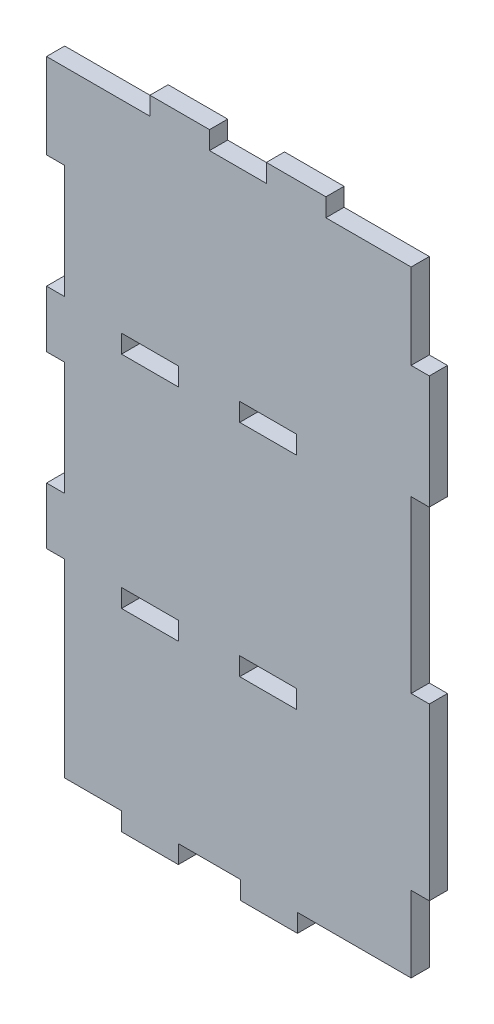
ISO-10303-21;
HEADER;
FILE_DESCRIPTION(('STEP AP214'),'2;1');
FILE_NAME('part.step','',(''),(''),'','','');
FILE_SCHEMA(('AUTOMOTIVE_DESIGN { 1 0 10303 214 1 1 1 1 }'));
ENDSEC;
DATA;
#1=APPLICATION_CONTEXT('core data for automotive mechanical design processes');
#2=APPLICATION_PROTOCOL_DEFINITION('international standard','automotive_design',2000,#1);
#3=PRODUCT_CONTEXT('',#1,'mechanical');
#4=PRODUCT('Part','Part','',(#3));
#5=PRODUCT_RELATED_PRODUCT_CATEGORY('part','',(#4));
#6=PRODUCT_DEFINITION_FORMATION('','',#4);
#7=PRODUCT_DEFINITION_CONTEXT('part definition',#1,'design');
#8=PRODUCT_DEFINITION('design','',#6,#7);
#9=PRODUCT_DEFINITION_SHAPE('','',#8);
#10=(LENGTH_UNIT() NAMED_UNIT(*) SI_UNIT(.MILLI.,.METRE.));
#11=(NAMED_UNIT(*) PLANE_ANGLE_UNIT() SI_UNIT($,.RADIAN.));
#12=(NAMED_UNIT(*) SI_UNIT($,.STERADIAN.) SOLID_ANGLE_UNIT());
#13=UNCERTAINTY_MEASURE_WITH_UNIT(LENGTH_MEASURE(1.E-05),#10,'distance_accuracy_value','');
#14=(GEOMETRIC_REPRESENTATION_CONTEXT(3) GLOBAL_UNCERTAINTY_ASSIGNED_CONTEXT((#13)) GLOBAL_UNIT_ASSIGNED_CONTEXT((#10,
#11,#12)) REPRESENTATION_CONTEXT('',''));
#15=CARTESIAN_POINT('',(0.,0.,0.));
#16=DIRECTION('',(0.,0.,1.));
#17=DIRECTION('',(1.,0.,0.));
#18=AXIS2_PLACEMENT_3D('',#15,#16,#17);
#19=CARTESIAN_POINT('',(0.,259.2,16.));
#20=DIRECTION('',(0.,1.,0.));
#21=DIRECTION('',(0.,0.,1.));
#22=AXIS2_PLACEMENT_3D('',#19,#20,#21);
#23=PLANE('',#22);
#24=DIRECTION('',(1.,0.,0.));
#25=VECTOR('',#24,1.);
#26=CARTESIAN_POINT('',(0.,259.2,0.));
#27=LINE('',#26,#25);
#28=CARTESIAN_POINT('',(53.970918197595,259.2,0.));
#29=VERTEX_POINT('',#28);
#30=CARTESIAN_POINT('',(103.970918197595,259.2,0.));
#31=VERTEX_POINT('',#30);
#32=EDGE_CURVE('E610',#29,#31,#27,.T.);
#33=ORIENTED_EDGE('',*,*,#32,.T.);
#34=DIRECTION('',(0.,0.,-1.));
#35=VECTOR('',#34,1.);
#36=CARTESIAN_POINT('',(103.970918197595,259.2,16.));
#37=LINE('',#36,#35);
#38=CARTESIAN_POINT('',(103.970918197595,259.2,16.));
#39=VERTEX_POINT('',#38);
#40=EDGE_CURVE('E357',#39,#31,#37,.T.);
#41=ORIENTED_EDGE('',*,*,#40,.F.);
#42=DIRECTION('',(1.,0.,0.));
#43=VECTOR('',#42,1.);
#44=CARTESIAN_POINT('',(0.,259.2,16.));
#45=LINE('',#44,#43);
#46=CARTESIAN_POINT('',(53.970918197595,259.2,16.));
#47=VERTEX_POINT('',#46);
#48=EDGE_CURVE('E386',#47,#39,#45,.T.);
#49=ORIENTED_EDGE('',*,*,#48,.F.);
#50=DIRECTION('',(0.,0.,-1.));
#51=VECTOR('',#50,1.);
#52=CARTESIAN_POINT('',(53.970918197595,259.2,16.));
#53=LINE('',#52,#51);
#54=EDGE_CURVE('E340',#47,#29,#53,.T.);
#55=ORIENTED_EDGE('',*,*,#54,.T.);
#56=EDGE_LOOP('',(#33,#41,#49,#55));
#57=FACE_BOUND('',#56,.T.);
#58=ADVANCED_FACE('F227',(#57),#23,.F.);
#59=CARTESIAN_POINT('',(53.970918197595,0.,16.));
#60=DIRECTION('',(-1.,0.,0.));
#61=DIRECTION('',(0.,0.,1.));
#62=AXIS2_PLACEMENT_3D('',#59,#60,#61);
#63=PLANE('',#62);
#64=DIRECTION('',(0.,1.,0.));
#65=VECTOR('',#64,1.);
#66=CARTESIAN_POINT('',(53.970918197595,0.,0.));
#67=LINE('',#66,#65);
#68=CARTESIAN_POINT('',(53.970918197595,243.2,0.));
#69=VERTEX_POINT('',#68);
#70=EDGE_CURVE('E607',#69,#29,#67,.T.);
#71=ORIENTED_EDGE('',*,*,#70,.T.);
#72=ORIENTED_EDGE('',*,*,#54,.F.);
#73=DIRECTION('',(0.,1.,0.));
#74=VECTOR('',#73,1.);
#75=CARTESIAN_POINT('',(53.970918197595,0.,16.));
#76=LINE('',#75,#74);
#77=CARTESIAN_POINT('',(53.970918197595,243.2,16.));
#78=VERTEX_POINT('',#77);
#79=EDGE_CURVE('E641',#78,#47,#76,.T.);
#80=ORIENTED_EDGE('',*,*,#79,.F.);
#81=DIRECTION('',(0.,0.,-1.));
#82=VECTOR('',#81,1.);
#83=CARTESIAN_POINT('',(53.970918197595,243.2,16.));
#84=LINE('',#83,#82);
#85=EDGE_CURVE('E331',#78,#69,#84,.T.);
#86=ORIENTED_EDGE('',*,*,#85,.T.);
#87=EDGE_LOOP('',(#71,#72,#80,#86));
#88=FACE_BOUND('',#87,.T.);
#89=ADVANCED_FACE('F631',(#88),#63,.F.);
#90=CARTESIAN_POINT('',(0.,243.2,16.));
#91=DIRECTION('',(0.,1.,0.));
#92=DIRECTION('',(0.,0.,1.));
#93=AXIS2_PLACEMENT_3D('',#90,#91,#92);
#94=PLANE('',#93);
#95=DIRECTION('',(1.,0.,0.));
#96=VECTOR('',#95,1.);
#97=CARTESIAN_POINT('',(0.,243.2,0.));
#98=LINE('',#97,#96);
#99=CARTESIAN_POINT('',(103.970918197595,243.2,0.));
#100=VERTEX_POINT('',#99);
#101=EDGE_CURVE('E604',#69,#100,#98,.T.);
#102=ORIENTED_EDGE('',*,*,#101,.F.);
#103=ORIENTED_EDGE('',*,*,#85,.F.);
#104=DIRECTION('',(1.,0.,0.));
#105=VECTOR('',#104,1.);
#106=CARTESIAN_POINT('',(0.,243.2,16.));
#107=LINE('',#106,#105);
#108=CARTESIAN_POINT('',(103.970918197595,243.2,16.));
#109=VERTEX_POINT('',#108);
#110=EDGE_CURVE('E639',#78,#109,#107,.T.);
#111=ORIENTED_EDGE('',*,*,#110,.T.);
#112=DIRECTION('',(0.,0.,-1.));
#113=VECTOR('',#112,1.);
#114=CARTESIAN_POINT('',(103.970918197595,243.2,16.));
#115=LINE('',#114,#113);
#116=EDGE_CURVE('E327',#109,#100,#115,.T.);
#117=ORIENTED_EDGE('',*,*,#116,.T.);
#118=EDGE_LOOP('',(#102,#103,#111,#117));
#119=FACE_BOUND('',#118,.T.);
#120=ADVANCED_FACE('F635',(#119),#94,.T.);
#121=CARTESIAN_POINT('',(103.970918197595,0.,16.));
#122=DIRECTION('',(-1.,0.,0.));
#123=DIRECTION('',(0.,0.,1.));
#124=AXIS2_PLACEMENT_3D('',#121,#122,#123);
#125=PLANE('',#124);
#126=DIRECTION('',(0.,1.,0.));
#127=VECTOR('',#126,1.);
#128=CARTESIAN_POINT('',(103.970918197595,0.,0.));
#129=LINE('',#128,#127);
#130=EDGE_CURVE('E601',#100,#31,#129,.T.);
#131=ORIENTED_EDGE('',*,*,#130,.F.);
#132=ORIENTED_EDGE('',*,*,#116,.F.);
#133=DIRECTION('',(0.,1.,0.));
#134=VECTOR('',#133,1.);
#135=CARTESIAN_POINT('',(103.970918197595,0.,16.));
#136=LINE('',#135,#134);
#137=EDGE_CURVE('E647',#109,#39,#136,.T.);
#138=ORIENTED_EDGE('',*,*,#137,.T.);
#139=ORIENTED_EDGE('',*,*,#40,.T.);
#140=EDGE_LOOP('',(#131,#132,#138,#139));
#141=FACE_BOUND('',#140,.T.);
#142=ADVANCED_FACE('F938',(#141),#125,.T.);
#143=CARTESIAN_POINT('',(0.,453.,16.));
#144=DIRECTION('',(0.,1.,0.));
#145=DIRECTION('',(0.,0.,1.));
#146=AXIS2_PLACEMENT_3D('',#143,#144,#145);
#147=PLANE('',#146);
#148=DIRECTION('',(1.,0.,0.));
#149=VECTOR('',#148,1.);
#150=CARTESIAN_POINT('',(0.,453.,0.));
#151=LINE('',#150,#149);
#152=CARTESIAN_POINT('',(157.970918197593,453.,0.));
#153=VERTEX_POINT('',#152);
#154=CARTESIAN_POINT('',(207.970918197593,453.,0.));
#155=VERTEX_POINT('',#154);
#156=EDGE_CURVE('E598',#153,#155,#151,.T.);
#157=ORIENTED_EDGE('',*,*,#156,.T.);
#158=DIRECTION('',(0.,0.,-1.));
#159=VECTOR('',#158,1.);
#160=CARTESIAN_POINT('',(207.970918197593,453.,16.));
#161=LINE('',#160,#159);
#162=CARTESIAN_POINT('',(207.970918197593,453.,16.));
#163=VERTEX_POINT('',#162);
#164=EDGE_CURVE('E344',#163,#155,#161,.T.);
#165=ORIENTED_EDGE('',*,*,#164,.F.);
#166=DIRECTION('',(1.,0.,0.));
#167=VECTOR('',#166,1.);
#168=CARTESIAN_POINT('',(0.,453.,16.));
#169=LINE('',#168,#167);
#170=CARTESIAN_POINT('',(157.970918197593,453.,16.));
#171=VERTEX_POINT('',#170);
#172=EDGE_CURVE('E649',#171,#163,#169,.T.);
#173=ORIENTED_EDGE('',*,*,#172,.F.);
#174=DIRECTION('',(0.,0.,-1.));
#175=VECTOR('',#174,1.);
#176=CARTESIAN_POINT('',(157.970918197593,453.,16.));
#177=LINE('',#176,#175);
#178=EDGE_CURVE('E347',#171,#153,#177,.T.);
#179=ORIENTED_EDGE('',*,*,#178,.T.);
#180=EDGE_LOOP('',(#157,#165,#173,#179));
#181=FACE_BOUND('',#180,.T.);
#182=ADVANCED_FACE('F808',(#181),#147,.F.);
#183=CARTESIAN_POINT('',(157.970918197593,0.,16.));
#184=DIRECTION('',(-1.,0.,0.));
#185=DIRECTION('',(0.,0.,1.));
#186=AXIS2_PLACEMENT_3D('',#183,#184,#185);
#187=PLANE('',#186);
#188=DIRECTION('',(0.,1.,0.));
#189=VECTOR('',#188,1.);
#190=CARTESIAN_POINT('',(157.970918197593,0.,0.));
#191=LINE('',#190,#189);
#192=CARTESIAN_POINT('',(157.970918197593,437.,0.));
#193=VERTEX_POINT('',#192);
#194=EDGE_CURVE('E595',#193,#153,#191,.T.);
#195=ORIENTED_EDGE('',*,*,#194,.T.);
#196=ORIENTED_EDGE('',*,*,#178,.F.);
#197=DIRECTION('',(0.,1.,0.));
#198=VECTOR('',#197,1.);
#199=CARTESIAN_POINT('',(157.970918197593,0.,16.));
#200=LINE('',#199,#198);
#201=CARTESIAN_POINT('',(157.970918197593,437.,16.));
#202=VERTEX_POINT('',#201);
#203=EDGE_CURVE('E793',#202,#171,#200,.T.);
#204=ORIENTED_EDGE('',*,*,#203,.F.);
#205=DIRECTION('',(0.,0.,-1.));
#206=VECTOR('',#205,1.);
#207=CARTESIAN_POINT('',(157.970918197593,437.,16.));
#208=LINE('',#207,#206);
#209=EDGE_CURVE('E351',#202,#193,#208,.T.);
#210=ORIENTED_EDGE('',*,*,#209,.T.);
#211=EDGE_LOOP('',(#195,#196,#204,#210));
#212=FACE_BOUND('',#211,.T.);
#213=ADVANCED_FACE('F945',(#212),#187,.F.);
#214=CARTESIAN_POINT('',(0.,437.,16.));
#215=DIRECTION('',(0.,1.,0.));
#216=DIRECTION('',(0.,0.,1.));
#217=AXIS2_PLACEMENT_3D('',#214,#215,#216);
#218=PLANE('',#217);
#219=DIRECTION('',(1.,0.,0.));
#220=VECTOR('',#219,1.);
#221=CARTESIAN_POINT('',(0.,437.,0.));
#222=LINE('',#221,#220);
#223=CARTESIAN_POINT('',(207.970918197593,437.,0.));
#224=VERTEX_POINT('',#223);
#225=EDGE_CURVE('E592',#193,#224,#222,.T.);
#226=ORIENTED_EDGE('',*,*,#225,.F.);
#227=ORIENTED_EDGE('',*,*,#209,.F.);
#228=DIRECTION('',(1.,0.,0.));
#229=VECTOR('',#228,1.);
#230=CARTESIAN_POINT('',(0.,437.,16.));
#231=LINE('',#230,#229);
#232=CARTESIAN_POINT('',(207.970918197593,437.,16.));
#233=VERTEX_POINT('',#232);
#234=EDGE_CURVE('E790',#202,#233,#231,.T.);
#235=ORIENTED_EDGE('',*,*,#234,.T.);
#236=DIRECTION('',(0.,0.,-1.));
#237=VECTOR('',#236,1.);
#238=CARTESIAN_POINT('',(207.970918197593,437.,16.));
#239=LINE('',#238,#237);
#240=EDGE_CURVE('E354',#233,#224,#239,.T.);
#241=ORIENTED_EDGE('',*,*,#240,.T.);
#242=EDGE_LOOP('',(#226,#227,#235,#241));
#243=FACE_BOUND('',#242,.T.);
#244=ADVANCED_FACE('F821',(#243),#218,.T.);
#245=CARTESIAN_POINT('',(207.970918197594,3.33066907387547E-13,16.));
#246=DIRECTION('',(-1.,0.,0.));
#247=DIRECTION('',(0.,-1.,0.));
#248=AXIS2_PLACEMENT_3D('',#245,#246,#247);
#249=PLANE('',#248);
#250=DIRECTION('',(0.,1.,0.));
#251=VECTOR('',#250,1.);
#252=CARTESIAN_POINT('',(207.970918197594,3.33066907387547E-13,0.));
#253=LINE('',#252,#251);
#254=EDGE_CURVE('E589',#224,#155,#253,.T.);
#255=ORIENTED_EDGE('',*,*,#254,.F.);
#256=ORIENTED_EDGE('',*,*,#240,.F.);
#257=DIRECTION('',(0.,1.,0.));
#258=VECTOR('',#257,1.);
#259=CARTESIAN_POINT('',(207.970918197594,3.33066907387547E-13,16.));
#260=LINE('',#259,#258);
#261=EDGE_CURVE('E787',#233,#163,#260,.T.);
#262=ORIENTED_EDGE('',*,*,#261,.T.);
#263=ORIENTED_EDGE('',*,*,#164,.T.);
#264=EDGE_LOOP('',(#255,#256,#262,#263));
#265=FACE_BOUND('',#264,.T.);
#266=ADVANCED_FACE('F814',(#265),#249,.T.);
#267=CARTESIAN_POINT('',(53.9709181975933,0.,16.));
#268=DIRECTION('',(1.,0.,0.));
#269=DIRECTION('',(0.,1.,0.));
#270=AXIS2_PLACEMENT_3D('',#267,#268,#269);
#271=PLANE('',#270);
#272=DIRECTION('',(0.,-1.,0.));
#273=VECTOR('',#272,1.);
#274=CARTESIAN_POINT('',(53.9709181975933,0.,0.));
#275=LINE('',#274,#273);
#276=CARTESIAN_POINT('',(53.970918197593,453.,0.));
#277=VERTEX_POINT('',#276);
#278=CARTESIAN_POINT('',(53.970918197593,437.,0.));
#279=VERTEX_POINT('',#278);
#280=EDGE_CURVE('E586',#277,#279,#275,.T.);
#281=ORIENTED_EDGE('',*,*,#280,.F.);
#282=DIRECTION('',(0.,0.,-1.));
#283=VECTOR('',#282,1.);
#284=CARTESIAN_POINT('',(53.970918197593,453.,16.));
#285=LINE('',#284,#283);
#286=CARTESIAN_POINT('',(53.970918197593,453.,16.));
#287=VERTEX_POINT('',#286);
#288=EDGE_CURVE('E358',#287,#277,#285,.T.);
#289=ORIENTED_EDGE('',*,*,#288,.F.);
#290=DIRECTION('',(0.,-1.,0.));
#291=VECTOR('',#290,1.);
#292=CARTESIAN_POINT('',(53.9709181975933,0.,16.));
#293=LINE('',#292,#291);
#294=CARTESIAN_POINT('',(53.970918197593,437.,16.));
#295=VERTEX_POINT('',#294);
#296=EDGE_CURVE('E784',#287,#295,#293,.T.);
#297=ORIENTED_EDGE('',*,*,#296,.T.);
#298=DIRECTION('',(0.,0.,-1.));
#299=VECTOR('',#298,1.);
#300=CARTESIAN_POINT('',(53.970918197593,437.,16.));
#301=LINE('',#300,#299);
#302=EDGE_CURVE('E361',#295,#279,#301,.T.);
#303=ORIENTED_EDGE('',*,*,#302,.T.);
#304=EDGE_LOOP('',(#281,#289,#297,#303));
#305=FACE_BOUND('',#304,.T.);
#306=ADVANCED_FACE('F914',(#305),#271,.T.);
#307=CARTESIAN_POINT('',(0.,437.,16.));
#308=DIRECTION('',(0.,1.,0.));
#309=DIRECTION('',(0.,0.,1.));
#310=AXIS2_PLACEMENT_3D('',#307,#308,#309);
#311=PLANE('',#310);
#312=DIRECTION('',(1.,0.,0.));
#313=VECTOR('',#312,1.);
#314=CARTESIAN_POINT('',(0.,437.,0.));
#315=LINE('',#314,#313);
#316=CARTESIAN_POINT('',(103.970918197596,437.,0.));
#317=VERTEX_POINT('',#316);
#318=EDGE_CURVE('E583',#279,#317,#315,.T.);
#319=ORIENTED_EDGE('',*,*,#318,.F.);
#320=ORIENTED_EDGE('',*,*,#302,.F.);
#321=DIRECTION('',(1.,0.,0.));
#322=VECTOR('',#321,1.);
#323=CARTESIAN_POINT('',(0.,437.,16.));
#324=LINE('',#323,#322);
#325=CARTESIAN_POINT('',(103.970918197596,437.,16.));
#326=VERTEX_POINT('',#325);
#327=EDGE_CURVE('E781',#295,#326,#324,.T.);
#328=ORIENTED_EDGE('',*,*,#327,.T.);
#329=DIRECTION('',(0.,0.,-1.));
#330=VECTOR('',#329,1.);
#331=CARTESIAN_POINT('',(103.970918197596,437.,16.));
#332=LINE('',#331,#330);
#333=EDGE_CURVE('E365',#326,#317,#332,.T.);
#334=ORIENTED_EDGE('',*,*,#333,.T.);
#335=EDGE_LOOP('',(#319,#320,#328,#334));
#336=FACE_BOUND('',#335,.T.);
#337=ADVANCED_FACE('F920',(#336),#311,.T.);
#338=CARTESIAN_POINT('',(103.970918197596,1.11022302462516E-13,16.));
#339=DIRECTION('',(1.,0.,0.));
#340=DIRECTION('',(0.,1.,0.));
#341=AXIS2_PLACEMENT_3D('',#338,#339,#340);
#342=PLANE('',#341);
#343=DIRECTION('',(0.,-1.,0.));
#344=VECTOR('',#343,1.);
#345=CARTESIAN_POINT('',(103.970918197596,1.11022302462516E-13,0.));
#346=LINE('',#345,#344);
#347=CARTESIAN_POINT('',(103.970918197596,453.,0.));
#348=VERTEX_POINT('',#347);
#349=EDGE_CURVE('E580',#348,#317,#346,.T.);
#350=ORIENTED_EDGE('',*,*,#349,.T.);
#351=ORIENTED_EDGE('',*,*,#333,.F.);
#352=DIRECTION('',(0.,-1.,0.));
#353=VECTOR('',#352,1.);
#354=CARTESIAN_POINT('',(103.970918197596,1.11022302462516E-13,16.));
#355=LINE('',#354,#353);
#356=CARTESIAN_POINT('',(103.970918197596,453.,16.));
#357=VERTEX_POINT('',#356);
#358=EDGE_CURVE('E778',#357,#326,#355,.T.);
#359=ORIENTED_EDGE('',*,*,#358,.F.);
#360=DIRECTION('',(0.,0.,-1.));
#361=VECTOR('',#360,1.);
#362=CARTESIAN_POINT('',(103.970918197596,453.,16.));
#363=LINE('',#362,#361);
#364=EDGE_CURVE('E348',#357,#348,#363,.T.);
#365=ORIENTED_EDGE('',*,*,#364,.T.);
#366=EDGE_LOOP('',(#350,#351,#359,#365));
#367=FACE_BOUND('',#366,.T.);
#368=ADVANCED_FACE('F1110',(#367),#342,.F.);
#369=CARTESIAN_POINT('',(0.,453.,16.));
#370=DIRECTION('',(0.,1.,0.));
#371=DIRECTION('',(0.,0.,1.));
#372=AXIS2_PLACEMENT_3D('',#369,#370,#371);
#373=PLANE('',#372);
#374=DIRECTION('',(1.,0.,0.));
#375=VECTOR('',#374,1.);
#376=CARTESIAN_POINT('',(0.,453.,0.));
#377=LINE('',#376,#375);
#378=EDGE_CURVE('E577',#277,#348,#377,.T.);
#379=ORIENTED_EDGE('',*,*,#378,.T.);
#380=ORIENTED_EDGE('',*,*,#364,.F.);
#381=DIRECTION('',(1.,0.,0.));
#382=VECTOR('',#381,1.);
#383=CARTESIAN_POINT('',(0.,453.,16.));
#384=LINE('',#383,#382);
#385=EDGE_CURVE('E775',#287,#357,#384,.T.);
#386=ORIENTED_EDGE('',*,*,#385,.F.);
#387=ORIENTED_EDGE('',*,*,#288,.T.);
#388=EDGE_LOOP('',(#379,#380,#386,#387));
#389=FACE_BOUND('',#388,.T.);
#390=ADVANCED_FACE('F927',(#389),#373,.F.);
#391=CARTESIAN_POINT('',(157.970918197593,0.,16.));
#392=DIRECTION('',(1.,0.,0.));
#393=DIRECTION('',(0.,0.,-1.));
#394=AXIS2_PLACEMENT_3D('',#391,#392,#393);
#395=PLANE('',#394);
#396=DIRECTION('',(0.,-1.,0.));
#397=VECTOR('',#396,1.);
#398=CARTESIAN_POINT('',(157.970918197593,0.,0.));
#399=LINE('',#398,#397);
#400=CARTESIAN_POINT('',(157.970918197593,259.2,0.));
#401=VERTEX_POINT('',#400);
#402=CARTESIAN_POINT('',(157.970918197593,243.2,0.));
#403=VERTEX_POINT('',#402);
#404=EDGE_CURVE('E574',#401,#403,#399,.T.);
#405=ORIENTED_EDGE('',*,*,#404,.F.);
#406=DIRECTION('',(0.,0.,-1.));
#407=VECTOR('',#406,1.);
#408=CARTESIAN_POINT('',(157.970918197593,259.2,16.));
#409=LINE('',#408,#407);
#410=CARTESIAN_POINT('',(157.970918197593,259.2,16.));
#411=VERTEX_POINT('',#410);
#412=EDGE_CURVE('E370',#411,#401,#409,.T.);
#413=ORIENTED_EDGE('',*,*,#412,.F.);
#414=DIRECTION('',(0.,-1.,0.));
#415=VECTOR('',#414,1.);
#416=CARTESIAN_POINT('',(157.970918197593,0.,16.));
#417=LINE('',#416,#415);
#418=CARTESIAN_POINT('',(157.970918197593,243.2,16.));
#419=VERTEX_POINT('',#418);
#420=EDGE_CURVE('E772',#411,#419,#417,.T.);
#421=ORIENTED_EDGE('',*,*,#420,.T.);
#422=DIRECTION('',(0.,0.,-1.));
#423=VECTOR('',#422,1.);
#424=CARTESIAN_POINT('',(157.970918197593,243.2,16.));
#425=LINE('',#424,#423);
#426=EDGE_CURVE('E373',#419,#403,#425,.T.);
#427=ORIENTED_EDGE('',*,*,#426,.T.);
#428=EDGE_LOOP('',(#405,#413,#421,#427));
#429=FACE_BOUND('',#428,.T.);
#430=ADVANCED_FACE('F1103',(#429),#395,.T.);
#431=CARTESIAN_POINT('',(0.,243.2,16.));
#432=DIRECTION('',(0.,1.,0.));
#433=DIRECTION('',(0.,0.,1.));
#434=AXIS2_PLACEMENT_3D('',#431,#432,#433);
#435=PLANE('',#434);
#436=DIRECTION('',(1.,0.,0.));
#437=VECTOR('',#436,1.);
#438=CARTESIAN_POINT('',(0.,243.2,0.));
#439=LINE('',#438,#437);
#440=CARTESIAN_POINT('',(207.970918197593,243.2,0.));
#441=VERTEX_POINT('',#440);
#442=EDGE_CURVE('E571',#403,#441,#439,.T.);
#443=ORIENTED_EDGE('',*,*,#442,.F.);
#444=ORIENTED_EDGE('',*,*,#426,.F.);
#445=DIRECTION('',(1.,0.,0.));
#446=VECTOR('',#445,1.);
#447=CARTESIAN_POINT('',(0.,243.2,16.));
#448=LINE('',#447,#446);
#449=CARTESIAN_POINT('',(207.970918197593,243.2,16.));
#450=VERTEX_POINT('',#449);
#451=EDGE_CURVE('E769',#419,#450,#448,.T.);
#452=ORIENTED_EDGE('',*,*,#451,.T.);
#453=DIRECTION('',(0.,0.,-1.));
#454=VECTOR('',#453,1.);
#455=CARTESIAN_POINT('',(207.970918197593,243.2,16.));
#456=LINE('',#455,#454);
#457=EDGE_CURVE('E377',#450,#441,#456,.T.);
#458=ORIENTED_EDGE('',*,*,#457,.T.);
#459=EDGE_LOOP('',(#443,#444,#452,#458));
#460=FACE_BOUND('',#459,.T.);
#461=ADVANCED_FACE('F1099',(#460),#435,.T.);
#462=CARTESIAN_POINT('',(207.970918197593,0.,16.));
#463=DIRECTION('',(1.,0.,0.));
#464=DIRECTION('',(0.,0.,-1.));
#465=AXIS2_PLACEMENT_3D('',#462,#463,#464);
#466=PLANE('',#465);
#467=DIRECTION('',(0.,-1.,0.));
#468=VECTOR('',#467,1.);
#469=CARTESIAN_POINT('',(207.970918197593,0.,0.));
#470=LINE('',#469,#468);
#471=CARTESIAN_POINT('',(207.970918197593,259.2,0.));
#472=VERTEX_POINT('',#471);
#473=EDGE_CURVE('E568',#472,#441,#470,.T.);
#474=ORIENTED_EDGE('',*,*,#473,.T.);
#475=ORIENTED_EDGE('',*,*,#457,.F.);
#476=DIRECTION('',(0.,-1.,0.));
#477=VECTOR('',#476,1.);
#478=CARTESIAN_POINT('',(207.970918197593,0.,16.));
#479=LINE('',#478,#477);
#480=CARTESIAN_POINT('',(207.970918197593,259.2,16.));
#481=VERTEX_POINT('',#480);
#482=EDGE_CURVE('E766',#481,#450,#479,.T.);
#483=ORIENTED_EDGE('',*,*,#482,.F.);
#484=DIRECTION('',(0.,0.,-1.));
#485=VECTOR('',#484,1.);
#486=CARTESIAN_POINT('',(207.970918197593,259.2,16.));
#487=LINE('',#486,#485);
#488=EDGE_CURVE('E362',#481,#472,#487,.T.);
#489=ORIENTED_EDGE('',*,*,#488,.T.);
#490=EDGE_LOOP('',(#474,#475,#483,#489));
#491=FACE_BOUND('',#490,.T.);
#492=ADVANCED_FACE('F1095',(#491),#466,.F.);
#493=CARTESIAN_POINT('',(0.,259.2,16.));
#494=DIRECTION('',(0.,1.,0.));
#495=DIRECTION('',(0.,0.,1.));
#496=AXIS2_PLACEMENT_3D('',#493,#494,#495);
#497=PLANE('',#496);
#498=DIRECTION('',(1.,0.,0.));
#499=VECTOR('',#498,1.);
#500=CARTESIAN_POINT('',(0.,259.2,0.));
#501=LINE('',#500,#499);
#502=EDGE_CURVE('E565',#401,#472,#501,.T.);
#503=ORIENTED_EDGE('',*,*,#502,.T.);
#504=ORIENTED_EDGE('',*,*,#488,.F.);
#505=DIRECTION('',(1.,0.,0.));
#506=VECTOR('',#505,1.);
#507=CARTESIAN_POINT('',(0.,259.2,16.));
#508=LINE('',#507,#506);
#509=EDGE_CURVE('E763',#411,#481,#508,.T.);
#510=ORIENTED_EDGE('',*,*,#509,.F.);
#511=ORIENTED_EDGE('',*,*,#412,.T.);
#512=EDGE_LOOP('',(#503,#504,#510,#511));
#513=FACE_BOUND('',#512,.T.);
#514=ADVANCED_FACE('F1091',(#513),#497,.F.);
#515=CARTESIAN_POINT('',(0.,455.8,16.));
#516=DIRECTION('',(0.,1.,0.));
#517=DIRECTION('',(0.,0.,1.));
#518=AXIS2_PLACEMENT_3D('',#515,#516,#517);
#519=PLANE('',#518);
#520=DIRECTION('',(1.,0.,0.));
#521=VECTOR('',#520,1.);
#522=CARTESIAN_POINT('',(0.,455.8,0.));
#523=LINE('',#522,#521);
#524=CARTESIAN_POINT('',(308.770918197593,455.8,0.));
#525=VERTEX_POINT('',#524);
#526=CARTESIAN_POINT('',(324.770918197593,455.8,0.));
#527=VERTEX_POINT('',#526);
#528=EDGE_CURVE('E562',#525,#527,#523,.T.);
#529=ORIENTED_EDGE('',*,*,#528,.T.);
#530=DIRECTION('',(0.,0.,-1.));
#531=VECTOR('',#530,1.);
#532=CARTESIAN_POINT('',(324.770918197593,455.8,16.));
#533=LINE('',#532,#531);
#534=CARTESIAN_POINT('',(324.770918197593,455.8,16.));
#535=VERTEX_POINT('',#534);
#536=EDGE_CURVE('E382',#535,#527,#533,.T.);
#537=ORIENTED_EDGE('',*,*,#536,.F.);
#538=DIRECTION('',(1.,0.,0.));
#539=VECTOR('',#538,1.);
#540=CARTESIAN_POINT('',(0.,455.8,16.));
#541=LINE('',#540,#539);
#542=CARTESIAN_POINT('',(308.770918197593,455.8,16.));
#543=VERTEX_POINT('',#542);
#544=EDGE_CURVE('E760',#543,#535,#541,.T.);
#545=ORIENTED_EDGE('',*,*,#544,.F.);
#546=DIRECTION('',(0.,0.,-1.));
#547=VECTOR('',#546,1.);
#548=CARTESIAN_POINT('',(308.770918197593,455.8,16.));
#549=LINE('',#548,#547);
#550=EDGE_CURVE('E385',#543,#525,#549,.T.);
#551=ORIENTED_EDGE('',*,*,#550,.T.);
#552=EDGE_LOOP('',(#529,#537,#545,#551));
#553=FACE_BOUND('',#552,.T.);
#554=ADVANCED_FACE('F1087',(#553),#519,.F.);
#555=CARTESIAN_POINT('',(308.770918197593,0.,16.));
#556=DIRECTION('',(-1.,0.,0.));
#557=DIRECTION('',(0.,0.,1.));
#558=AXIS2_PLACEMENT_3D('',#555,#556,#557);
#559=PLANE('',#558);
#560=DIRECTION('',(0.,1.,0.));
#561=VECTOR('',#560,1.);
#562=CARTESIAN_POINT('',(308.770918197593,0.,0.));
#563=LINE('',#562,#561);
#564=CARTESIAN_POINT('',(308.770918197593,305.8,0.));
#565=VERTEX_POINT('',#564);
#566=EDGE_CURVE('E561',#565,#525,#563,.T.);
#567=ORIENTED_EDGE('',*,*,#566,.T.);
#568=ORIENTED_EDGE('',*,*,#550,.F.);
#569=DIRECTION('',(0.,1.,0.));
#570=VECTOR('',#569,1.);
#571=CARTESIAN_POINT('',(308.770918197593,0.,16.));
#572=LINE('',#571,#570);
#573=CARTESIAN_POINT('',(308.770918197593,305.8,16.));
#574=VERTEX_POINT('',#573);
#575=EDGE_CURVE('E759',#574,#543,#572,.T.);
#576=ORIENTED_EDGE('',*,*,#575,.F.);
#577=DIRECTION('',(0.,0.,-1.));
#578=VECTOR('',#577,1.);
#579=CARTESIAN_POINT('',(308.770918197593,305.8,16.));
#580=LINE('',#579,#578);
#581=EDGE_CURVE('E389',#574,#565,#580,.T.);
#582=ORIENTED_EDGE('',*,*,#581,.T.);
#583=EDGE_LOOP('',(#567,#568,#576,#582));
#584=FACE_BOUND('',#583,.T.);
#585=ADVANCED_FACE('F1083',(#584),#559,.F.);
#586=CARTESIAN_POINT('',(0.,305.8,16.));
#587=DIRECTION('',(0.,1.,0.));
#588=DIRECTION('',(0.,0.,1.));
#589=AXIS2_PLACEMENT_3D('',#586,#587,#588);
#590=PLANE('',#589);
#591=DIRECTION('',(1.,0.,0.));
#592=VECTOR('',#591,1.);
#593=CARTESIAN_POINT('',(0.,305.8,0.));
#594=LINE('',#593,#592);
#595=CARTESIAN_POINT('',(324.770918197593,305.8,0.));
#596=VERTEX_POINT('',#595);
#597=EDGE_CURVE('E558',#565,#596,#594,.T.);
#598=ORIENTED_EDGE('',*,*,#597,.F.);
#599=ORIENTED_EDGE('',*,*,#581,.F.);
#600=DIRECTION('',(1.,0.,0.));
#601=VECTOR('',#600,1.);
#602=CARTESIAN_POINT('',(0.,305.8,16.));
#603=LINE('',#602,#601);
#604=CARTESIAN_POINT('',(324.770918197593,305.8,16.));
#605=VERTEX_POINT('',#604);
#606=EDGE_CURVE('E756',#574,#605,#603,.T.);
#607=ORIENTED_EDGE('',*,*,#606,.T.);
#608=DIRECTION('',(0.,0.,-1.));
#609=VECTOR('',#608,1.);
#610=CARTESIAN_POINT('',(324.770918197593,305.8,16.));
#611=LINE('',#610,#609);
#612=EDGE_CURVE('E392',#605,#596,#611,.T.);
#613=ORIENTED_EDGE('',*,*,#612,.T.);
#614=EDGE_LOOP('',(#598,#599,#607,#613));
#615=FACE_BOUND('',#614,.T.);
#616=ADVANCED_FACE('F1079',(#615),#590,.T.);
#617=CARTESIAN_POINT('',(324.770918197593,0.,16.));
#618=DIRECTION('',(1.,0.,0.));
#619=DIRECTION('',(0.,0.,-1.));
#620=AXIS2_PLACEMENT_3D('',#617,#618,#619);
#621=PLANE('',#620);
#622=DIRECTION('',(0.,-1.,0.));
#623=VECTOR('',#622,1.);
#624=CARTESIAN_POINT('',(324.770918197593,0.,0.));
#625=LINE('',#624,#623);
#626=CARTESIAN_POINT('',(324.770918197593,155.8,0.));
#627=VERTEX_POINT('',#626);
#628=EDGE_CURVE('E554',#596,#627,#625,.T.);
#629=ORIENTED_EDGE('',*,*,#628,.F.);
#630=ORIENTED_EDGE('',*,*,#612,.F.);
#631=DIRECTION('',(0.,-1.,0.));
#632=VECTOR('',#631,1.);
#633=CARTESIAN_POINT('',(324.770918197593,0.,16.));
#634=LINE('',#633,#632);
#635=CARTESIAN_POINT('',(324.770918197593,155.8,16.));
#636=VERTEX_POINT('',#635);
#637=EDGE_CURVE('E752',#605,#636,#634,.T.);
#638=ORIENTED_EDGE('',*,*,#637,.T.);
#639=DIRECTION('',(0.,0.,-1.));
#640=VECTOR('',#639,1.);
#641=CARTESIAN_POINT('',(324.770918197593,155.8,16.));
#642=LINE('',#641,#640);
#643=EDGE_CURVE('E395',#636,#627,#642,.T.);
#644=ORIENTED_EDGE('',*,*,#643,.T.);
#645=EDGE_LOOP('',(#629,#630,#638,#644));
#646=FACE_BOUND('',#645,.T.);
#647=ADVANCED_FACE('F1075',(#646),#621,.T.);
#648=CARTESIAN_POINT('',(0.,155.8,16.));
#649=DIRECTION('',(0.,1.,0.));
#650=DIRECTION('',(0.,0.,1.));
#651=AXIS2_PLACEMENT_3D('',#648,#649,#650);
#652=PLANE('',#651);
#653=DIRECTION('',(1.,0.,0.));
#654=VECTOR('',#653,1.);
#655=CARTESIAN_POINT('',(0.,155.8,0.));
#656=LINE('',#655,#654);
#657=CARTESIAN_POINT('',(308.770918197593,155.8,0.));
#658=VERTEX_POINT('',#657);
#659=EDGE_CURVE('E551',#658,#627,#656,.T.);
#660=ORIENTED_EDGE('',*,*,#659,.T.);
#661=ORIENTED_EDGE('',*,*,#643,.F.);
#662=DIRECTION('',(1.,0.,0.));
#663=VECTOR('',#662,1.);
#664=CARTESIAN_POINT('',(0.,155.8,16.));
#665=LINE('',#664,#663);
#666=CARTESIAN_POINT('',(308.770918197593,155.8,16.));
#667=VERTEX_POINT('',#666);
#668=EDGE_CURVE('E749',#667,#636,#665,.T.);
#669=ORIENTED_EDGE('',*,*,#668,.F.);
#670=DIRECTION('',(0.,0.,-1.));
#671=VECTOR('',#670,1.);
#672=CARTESIAN_POINT('',(308.770918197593,155.8,16.));
#673=LINE('',#672,#671);
#674=EDGE_CURVE('E398',#667,#658,#673,.T.);
#675=ORIENTED_EDGE('',*,*,#674,.T.);
#676=EDGE_LOOP('',(#660,#661,#669,#675));
#677=FACE_BOUND('',#676,.T.);
#678=ADVANCED_FACE('F1072',(#677),#652,.F.);
#679=CARTESIAN_POINT('',(308.770918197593,89.0000000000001,0.));
#680=VERTEX_POINT('',#679);
#681=EDGE_CURVE('E555',#680,#658,#563,.T.);
#682=ORIENTED_EDGE('',*,*,#681,.T.);
#683=ORIENTED_EDGE('',*,*,#674,.F.);
#684=CARTESIAN_POINT('',(308.770918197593,89.0000000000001,16.));
#685=VERTEX_POINT('',#684);
#686=EDGE_CURVE('E753',#685,#667,#572,.T.);
#687=ORIENTED_EDGE('',*,*,#686,.F.);
#688=DIRECTION('',(0.,0.,-1.));
#689=VECTOR('',#688,1.);
#690=CARTESIAN_POINT('',(308.770918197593,89.0000000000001,16.));
#691=LINE('',#690,#689);
#692=EDGE_CURVE('E401',#685,#680,#691,.T.);
#693=ORIENTED_EDGE('',*,*,#692,.T.);
#694=EDGE_LOOP('',(#682,#683,#687,#693));
#695=FACE_BOUND('',#694,.T.);
#696=ADVANCED_FACE('F1070',(#695),#559,.F.);
#697=CARTESIAN_POINT('',(0.,89.0000000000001,16.));
#698=DIRECTION('',(0.,1.,0.));
#699=DIRECTION('',(0.,0.,1.));
#700=AXIS2_PLACEMENT_3D('',#697,#698,#699);
#701=PLANE('',#700);
#702=DIRECTION('',(1.,0.,0.));
#703=VECTOR('',#702,1.);
#704=CARTESIAN_POINT('',(0.,89.0000000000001,0.));
#705=LINE('',#704,#703);
#706=CARTESIAN_POINT('',(208.770918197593,89.0000000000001,0.));
#707=VERTEX_POINT('',#706);
#708=EDGE_CURVE('E532',#707,#680,#705,.T.);
#709=ORIENTED_EDGE('',*,*,#708,.T.);
#710=ORIENTED_EDGE('',*,*,#692,.F.);
#711=DIRECTION('',(1.,0.,0.));
#712=VECTOR('',#711,1.);
#713=CARTESIAN_POINT('',(0.,89.0000000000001,16.));
#714=LINE('',#713,#712);
#715=CARTESIAN_POINT('',(208.770918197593,89.0000000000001,16.));
#716=VERTEX_POINT('',#715);
#717=EDGE_CURVE('E730',#716,#685,#714,.T.);
#718=ORIENTED_EDGE('',*,*,#717,.F.);
#719=DIRECTION('',(0.,0.,-1.));
#720=VECTOR('',#719,1.);
#721=CARTESIAN_POINT('',(208.770918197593,89.0000000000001,16.));
#722=LINE('',#721,#720);
#723=EDGE_CURVE('E404',#716,#707,#722,.T.);
#724=ORIENTED_EDGE('',*,*,#723,.T.);
#725=EDGE_LOOP('',(#709,#710,#718,#724));
#726=FACE_BOUND('',#725,.T.);
#727=ADVANCED_FACE('F1066',(#726),#701,.F.);
#728=CARTESIAN_POINT('',(208.770918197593,3.88578058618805E-13,16.));
#729=DIRECTION('',(1.,0.,0.));
#730=DIRECTION('',(0.,1.,0.));
#731=AXIS2_PLACEMENT_3D('',#728,#729,#730);
#732=PLANE('',#731);
#733=DIRECTION('',(0.,-1.,0.));
#734=VECTOR('',#733,1.);
#735=CARTESIAN_POINT('',(208.770918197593,3.88578058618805E-13,0.));
#736=LINE('',#735,#734);
#737=CARTESIAN_POINT('',(208.770918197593,73.0000000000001,0.));
#738=VERTEX_POINT('',#737);
#739=EDGE_CURVE('E548',#707,#738,#736,.T.);
#740=ORIENTED_EDGE('',*,*,#739,.F.);
#741=ORIENTED_EDGE('',*,*,#723,.F.);
#742=DIRECTION('',(0.,-1.,0.));
#743=VECTOR('',#742,1.);
#744=CARTESIAN_POINT('',(208.770918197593,3.88578058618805E-13,16.));
#745=LINE('',#744,#743);
#746=CARTESIAN_POINT('',(208.770918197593,73.0000000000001,16.));
#747=VERTEX_POINT('',#746);
#748=EDGE_CURVE('E746',#716,#747,#745,.T.);
#749=ORIENTED_EDGE('',*,*,#748,.T.);
#750=DIRECTION('',(0.,0.,-1.));
#751=VECTOR('',#750,1.);
#752=CARTESIAN_POINT('',(208.770918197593,73.0000000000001,16.));
#753=LINE('',#752,#751);
#754=EDGE_CURVE('E407',#747,#738,#753,.T.);
#755=ORIENTED_EDGE('',*,*,#754,.T.);
#756=EDGE_LOOP('',(#740,#741,#749,#755));
#757=FACE_BOUND('',#756,.T.);
#758=ADVANCED_FACE('F1062',(#757),#732,.T.);
#759=CARTESIAN_POINT('',(0.,73.0000000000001,16.));
#760=DIRECTION('',(0.,-1.,0.));
#761=DIRECTION('',(0.,0.,-1.));
#762=AXIS2_PLACEMENT_3D('',#759,#760,#761);
#763=PLANE('',#762);
#764=DIRECTION('',(-1.,0.,0.));
#765=VECTOR('',#764,1.);
#766=CARTESIAN_POINT('',(0.,73.0000000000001,0.));
#767=LINE('',#766,#765);
#768=CARTESIAN_POINT('',(158.770918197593,73.0000000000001,0.));
#769=VERTEX_POINT('',#768);
#770=EDGE_CURVE('E545',#738,#769,#767,.T.);
#771=ORIENTED_EDGE('',*,*,#770,.F.);
#772=ORIENTED_EDGE('',*,*,#754,.F.);
#773=DIRECTION('',(-1.,0.,0.));
#774=VECTOR('',#773,1.);
#775=CARTESIAN_POINT('',(0.,73.0000000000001,16.));
#776=LINE('',#775,#774);
#777=CARTESIAN_POINT('',(158.770918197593,73.0000000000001,16.));
#778=VERTEX_POINT('',#777);
#779=EDGE_CURVE('E743',#747,#778,#776,.T.);
#780=ORIENTED_EDGE('',*,*,#779,.T.);
#781=DIRECTION('',(0.,0.,-1.));
#782=VECTOR('',#781,1.);
#783=CARTESIAN_POINT('',(158.770918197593,73.0000000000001,16.));
#784=LINE('',#783,#782);
#785=EDGE_CURVE('E410',#778,#769,#784,.T.);
#786=ORIENTED_EDGE('',*,*,#785,.T.);
#787=EDGE_LOOP('',(#771,#772,#780,#786));
#788=FACE_BOUND('',#787,.T.);
#789=ADVANCED_FACE('F1058',(#788),#763,.T.);
#790=CARTESIAN_POINT('',(158.770918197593,0.,16.));
#791=DIRECTION('',(1.,0.,0.));
#792=DIRECTION('',(0.,0.,-1.));
#793=AXIS2_PLACEMENT_3D('',#790,#791,#792);
#794=PLANE('',#793);
#795=DIRECTION('',(0.,-1.,0.));
#796=VECTOR('',#795,1.);
#797=CARTESIAN_POINT('',(158.770918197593,0.,0.));
#798=LINE('',#797,#796);
#799=CARTESIAN_POINT('',(158.770918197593,89.0000000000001,0.));
#800=VERTEX_POINT('',#799);
#801=EDGE_CURVE('E542',#800,#769,#798,.T.);
#802=ORIENTED_EDGE('',*,*,#801,.T.);
#803=ORIENTED_EDGE('',*,*,#785,.F.);
#804=DIRECTION('',(0.,-1.,0.));
#805=VECTOR('',#804,1.);
#806=CARTESIAN_POINT('',(158.770918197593,0.,16.));
#807=LINE('',#806,#805);
#808=CARTESIAN_POINT('',(158.770918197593,89.0000000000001,16.));
#809=VERTEX_POINT('',#808);
#810=EDGE_CURVE('E740',#809,#778,#807,.T.);
#811=ORIENTED_EDGE('',*,*,#810,.F.);
#812=DIRECTION('',(0.,0.,-1.));
#813=VECTOR('',#812,1.);
#814=CARTESIAN_POINT('',(158.770918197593,89.0000000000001,16.));
#815=LINE('',#814,#813);
#816=EDGE_CURVE('E413',#809,#800,#815,.T.);
#817=ORIENTED_EDGE('',*,*,#816,.T.);
#818=EDGE_LOOP('',(#802,#803,#811,#817));
#819=FACE_BOUND('',#818,.T.);
#820=ADVANCED_FACE('F1055',(#819),#794,.F.);
#821=CARTESIAN_POINT('',(103.970918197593,89.0000000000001,0.));
#822=VERTEX_POINT('',#821);
#823=EDGE_CURVE('E533',#822,#800,#705,.T.);
#824=ORIENTED_EDGE('',*,*,#823,.T.);
#825=ORIENTED_EDGE('',*,*,#816,.F.);
#826=CARTESIAN_POINT('',(103.970918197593,89.0000000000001,16.));
#827=VERTEX_POINT('',#826);
#828=EDGE_CURVE('E731',#827,#809,#714,.T.);
#829=ORIENTED_EDGE('',*,*,#828,.F.);
#830=DIRECTION('',(0.,0.,-1.));
#831=VECTOR('',#830,1.);
#832=CARTESIAN_POINT('',(103.970918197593,89.0000000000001,16.));
#833=LINE('',#832,#831);
#834=EDGE_CURVE('E416',#827,#822,#833,.T.);
#835=ORIENTED_EDGE('',*,*,#834,.T.);
#836=EDGE_LOOP('',(#824,#825,#829,#835));
#837=FACE_BOUND('',#836,.T.);
#838=ADVANCED_FACE('F1053',(#837),#701,.F.);
#839=CARTESIAN_POINT('',(103.970918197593,1.11022302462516E-13,16.));
#840=DIRECTION('',(1.,0.,0.));
#841=DIRECTION('',(0.,1.,0.));
#842=AXIS2_PLACEMENT_3D('',#839,#840,#841);
#843=PLANE('',#842);
#844=DIRECTION('',(0.,-1.,0.));
#845=VECTOR('',#844,1.);
#846=CARTESIAN_POINT('',(103.970918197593,1.11022302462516E-13,0.));
#847=LINE('',#846,#845);
#848=CARTESIAN_POINT('',(103.970918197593,73.0000000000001,0.));
#849=VERTEX_POINT('',#848);
#850=EDGE_CURVE('E539',#822,#849,#847,.T.);
#851=ORIENTED_EDGE('',*,*,#850,.F.);
#852=ORIENTED_EDGE('',*,*,#834,.F.);
#853=DIRECTION('',(0.,-1.,0.));
#854=VECTOR('',#853,1.);
#855=CARTESIAN_POINT('',(103.970918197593,1.11022302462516E-13,16.));
#856=LINE('',#855,#854);
#857=CARTESIAN_POINT('',(103.970918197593,73.0000000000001,16.));
#858=VERTEX_POINT('',#857);
#859=EDGE_CURVE('E737',#827,#858,#856,.T.);
#860=ORIENTED_EDGE('',*,*,#859,.T.);
#861=DIRECTION('',(0.,0.,-1.));
#862=VECTOR('',#861,1.);
#863=CARTESIAN_POINT('',(103.970918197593,73.0000000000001,16.));
#864=LINE('',#863,#862);
#865=EDGE_CURVE('E419',#858,#849,#864,.T.);
#866=ORIENTED_EDGE('',*,*,#865,.T.);
#867=EDGE_LOOP('',(#851,#852,#860,#866));
#868=FACE_BOUND('',#867,.T.);
#869=ADVANCED_FACE('F1047',(#868),#843,.T.);
#870=CARTESIAN_POINT('',(0.,73.0000000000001,16.));
#871=DIRECTION('',(0.,1.,0.));
#872=DIRECTION('',(-1.,0.,0.));
#873=AXIS2_PLACEMENT_3D('',#870,#871,#872);
#874=PLANE('',#873);
#875=DIRECTION('',(1.,0.,0.));
#876=VECTOR('',#875,1.);
#877=CARTESIAN_POINT('',(0.,73.0000000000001,0.));
#878=LINE('',#877,#876);
#879=CARTESIAN_POINT('',(53.970918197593,73.0000000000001,0.));
#880=VERTEX_POINT('',#879);
#881=EDGE_CURVE('E536',#880,#849,#878,.T.);
#882=ORIENTED_EDGE('',*,*,#881,.T.);
#883=ORIENTED_EDGE('',*,*,#865,.F.);
#884=DIRECTION('',(1.,0.,0.));
#885=VECTOR('',#884,1.);
#886=CARTESIAN_POINT('',(0.,73.0000000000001,16.));
#887=LINE('',#886,#885);
#888=CARTESIAN_POINT('',(53.970918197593,73.0000000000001,16.));
#889=VERTEX_POINT('',#888);
#890=EDGE_CURVE('E734',#889,#858,#887,.T.);
#891=ORIENTED_EDGE('',*,*,#890,.F.);
#892=DIRECTION('',(0.,0.,-1.));
#893=VECTOR('',#892,1.);
#894=CARTESIAN_POINT('',(53.970918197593,73.0000000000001,16.));
#895=LINE('',#894,#893);
#896=EDGE_CURVE('E422',#889,#880,#895,.T.);
#897=ORIENTED_EDGE('',*,*,#896,.T.);
#898=EDGE_LOOP('',(#882,#883,#891,#897));
#899=FACE_BOUND('',#898,.T.);
#900=ADVANCED_FACE('F1042',(#899),#874,.F.);
#901=CARTESIAN_POINT('',(53.970918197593,0.,16.));
#902=DIRECTION('',(1.,0.,0.));
#903=DIRECTION('',(0.,0.,-1.));
#904=AXIS2_PLACEMENT_3D('',#901,#902,#903);
#905=PLANE('',#904);
#906=DIRECTION('',(0.,-1.,0.));
#907=VECTOR('',#906,1.);
#908=CARTESIAN_POINT('',(53.970918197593,0.,0.));
#909=LINE('',#908,#907);
#910=CARTESIAN_POINT('',(53.970918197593,89.0000000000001,0.));
#911=VERTEX_POINT('',#910);
#912=EDGE_CURVE('E531',#911,#880,#909,.T.);
#913=ORIENTED_EDGE('',*,*,#912,.T.);
#914=ORIENTED_EDGE('',*,*,#896,.F.);
#915=DIRECTION('',(0.,-1.,0.));
#916=VECTOR('',#915,1.);
#917=CARTESIAN_POINT('',(53.970918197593,0.,16.));
#918=LINE('',#917,#916);
#919=CARTESIAN_POINT('',(53.970918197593,89.0000000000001,16.));
#920=VERTEX_POINT('',#919);
#921=EDGE_CURVE('E729',#920,#889,#918,.T.);
#922=ORIENTED_EDGE('',*,*,#921,.F.);
#923=DIRECTION('',(0.,0.,-1.));
#924=VECTOR('',#923,1.);
#925=CARTESIAN_POINT('',(53.970918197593,89.0000000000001,16.));
#926=LINE('',#925,#924);
#927=EDGE_CURVE('E425',#920,#911,#926,.T.);
#928=ORIENTED_EDGE('',*,*,#927,.T.);
#929=EDGE_LOOP('',(#913,#914,#922,#928));
#930=FACE_BOUND('',#929,.T.);
#931=ADVANCED_FACE('F1038',(#930),#905,.F.);
#932=CARTESIAN_POINT('',(0.,630.8,16.));
#933=DIRECTION('',(0.,-1.,0.));
#934=DIRECTION('',(0.,0.,-1.));
#935=AXIS2_PLACEMENT_3D('',#932,#933,#934);
#936=PLANE('',#935);
#937=DIRECTION('',(-1.,0.,0.));
#938=VECTOR('',#937,1.);
#939=CARTESIAN_POINT('',(0.,630.8,0.));
#940=LINE('',#939,#938);
#941=CARTESIAN_POINT('',(78.9709181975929,630.8,0.));
#942=VERTEX_POINT('',#941);
#943=CARTESIAN_POINT('',(-12.0290818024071,630.8,0.));
#944=VERTEX_POINT('',#943);
#945=EDGE_CURVE('E525',#942,#944,#940,.T.);
#946=ORIENTED_EDGE('',*,*,#945,.T.);
#947=DIRECTION('',(0.,0.,-1.));
#948=VECTOR('',#947,1.);
#949=CARTESIAN_POINT('',(-12.0290818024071,630.8,16.));
#950=LINE('',#949,#948);
#951=CARTESIAN_POINT('',(-12.0290818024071,630.8,16.));
#952=VERTEX_POINT('',#951);
#953=EDGE_CURVE('E475',#952,#944,#950,.T.);
#954=ORIENTED_EDGE('',*,*,#953,.F.);
#955=DIRECTION('',(-1.,0.,0.));
#956=VECTOR('',#955,1.);
#957=CARTESIAN_POINT('',(0.,630.8,16.));
#958=LINE('',#957,#956);
#959=CARTESIAN_POINT('',(78.9709181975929,630.8,16.));
#960=VERTEX_POINT('',#959);
#961=EDGE_CURVE('E723',#960,#952,#958,.T.);
#962=ORIENTED_EDGE('',*,*,#961,.F.);
#963=DIRECTION('',(0.,0.,-1.));
#964=VECTOR('',#963,1.);
#965=CARTESIAN_POINT('',(78.9709181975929,630.8,16.));
#966=LINE('',#965,#964);
#967=EDGE_CURVE('E431',#960,#942,#966,.T.);
#968=ORIENTED_EDGE('',*,*,#967,.T.);
#969=EDGE_LOOP('',(#946,#954,#962,#968));
#970=FACE_BOUND('',#969,.T.);
#971=ADVANCED_FACE('F690',(#970),#936,.F.);
#972=CARTESIAN_POINT('',(78.9709181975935,0.,16.));
#973=DIRECTION('',(1.,0.,0.));
#974=DIRECTION('',(0.,1.,0.));
#975=AXIS2_PLACEMENT_3D('',#972,#973,#974);
#976=PLANE('',#975);
#977=DIRECTION('',(0.,-1.,0.));
#978=VECTOR('',#977,1.);
#979=CARTESIAN_POINT('',(78.9709181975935,0.,0.));
#980=LINE('',#979,#978);
#981=CARTESIAN_POINT('',(78.9709181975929,646.8,0.));
#982=VERTEX_POINT('',#981);
#983=EDGE_CURVE('E681',#982,#942,#980,.T.);
#984=ORIENTED_EDGE('',*,*,#983,.T.);
#985=ORIENTED_EDGE('',*,*,#967,.F.);
#986=DIRECTION('',(0.,-1.,0.));
#987=VECTOR('',#986,1.);
#988=CARTESIAN_POINT('',(78.9709181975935,0.,16.));
#989=LINE('',#988,#987);
#990=CARTESIAN_POINT('',(78.9709181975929,646.8,16.));
#991=VERTEX_POINT('',#990);
#992=EDGE_CURVE('E1515',#991,#960,#989,.T.);
#993=ORIENTED_EDGE('',*,*,#992,.F.);
#994=DIRECTION('',(0.,0.,-1.));
#995=VECTOR('',#994,1.);
#996=CARTESIAN_POINT('',(78.9709181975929,646.8,16.));
#997=LINE('',#996,#995);
#998=EDGE_CURVE('E434',#991,#982,#997,.T.);
#999=ORIENTED_EDGE('',*,*,#998,.T.);
#1000=EDGE_LOOP('',(#984,#985,#993,#999));
#1001=FACE_BOUND('',#1000,.T.);
#1002=ADVANCED_FACE('F1034',(#1001),#976,.F.);
#1003=CARTESIAN_POINT('',(0.,646.8,16.));
#1004=DIRECTION('',(0.,1.,0.));
#1005=DIRECTION('',(0.,0.,1.));
#1006=AXIS2_PLACEMENT_3D('',#1003,#1004,#1005);
#1007=PLANE('',#1006);
#1008=DIRECTION('',(1.,0.,0.));
#1009=VECTOR('',#1008,1.);
#1010=CARTESIAN_POINT('',(0.,646.8,0.));
#1011=LINE('',#1010,#1009);
#1012=CARTESIAN_POINT('',(131.370918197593,646.8,0.));
#1013=VERTEX_POINT('',#1012);
#1014=EDGE_CURVE('E679',#982,#1013,#1011,.T.);
#1015=ORIENTED_EDGE('',*,*,#1014,.F.);
#1016=ORIENTED_EDGE('',*,*,#998,.F.);
#1017=DIRECTION('',(1.,0.,0.));
#1018=VECTOR('',#1017,1.);
#1019=CARTESIAN_POINT('',(0.,646.8,16.));
#1020=LINE('',#1019,#1018);
#1021=CARTESIAN_POINT('',(131.370918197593,646.8,16.));
#1022=VERTEX_POINT('',#1021);
#1023=EDGE_CURVE('E1513',#991,#1022,#1020,.T.);
#1024=ORIENTED_EDGE('',*,*,#1023,.T.);
#1025=DIRECTION('',(0.,0.,-1.));
#1026=VECTOR('',#1025,1.);
#1027=CARTESIAN_POINT('',(131.370918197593,646.8,16.));
#1028=LINE('',#1027,#1026);
#1029=EDGE_CURVE('E437',#1022,#1013,#1028,.T.);
#1030=ORIENTED_EDGE('',*,*,#1029,.T.);
#1031=EDGE_LOOP('',(#1015,#1016,#1024,#1030));
#1032=FACE_BOUND('',#1031,.T.);
#1033=ADVANCED_FACE('F1030',(#1032),#1007,.T.);
#1034=CARTESIAN_POINT('',(131.370918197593,0.,16.));
#1035=DIRECTION('',(1.,0.,0.));
#1036=DIRECTION('',(0.,0.,-1.));
#1037=AXIS2_PLACEMENT_3D('',#1034,#1035,#1036);
#1038=PLANE('',#1037);
#1039=DIRECTION('',(0.,-1.,0.));
#1040=VECTOR('',#1039,1.);
#1041=CARTESIAN_POINT('',(131.370918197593,0.,0.));
#1042=LINE('',#1041,#1040);
#1043=CARTESIAN_POINT('',(131.370918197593,630.8,0.));
#1044=VERTEX_POINT('',#1043);
#1045=EDGE_CURVE('E676',#1013,#1044,#1042,.T.);
#1046=ORIENTED_EDGE('',*,*,#1045,.F.);
#1047=ORIENTED_EDGE('',*,*,#1029,.F.);
#1048=DIRECTION('',(0.,-1.,0.));
#1049=VECTOR('',#1048,1.);
#1050=CARTESIAN_POINT('',(131.370918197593,0.,16.));
#1051=LINE('',#1050,#1049);
#1052=CARTESIAN_POINT('',(131.370918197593,630.8,16.));
#1053=VERTEX_POINT('',#1052);
#1054=EDGE_CURVE('E1510',#1022,#1053,#1051,.T.);
#1055=ORIENTED_EDGE('',*,*,#1054,.T.);
#1056=DIRECTION('',(0.,0.,-1.));
#1057=VECTOR('',#1056,1.);
#1058=CARTESIAN_POINT('',(131.370918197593,630.8,16.));
#1059=LINE('',#1058,#1057);
#1060=EDGE_CURVE('E440',#1053,#1044,#1059,.T.);
#1061=ORIENTED_EDGE('',*,*,#1060,.T.);
#1062=EDGE_LOOP('',(#1046,#1047,#1055,#1061));
#1063=FACE_BOUND('',#1062,.T.);
#1064=ADVANCED_FACE('F1026',(#1063),#1038,.T.);
#1065=CARTESIAN_POINT('',(0.,630.8,16.));
#1066=DIRECTION('',(0.,1.,0.));
#1067=DIRECTION('',(0.,0.,1.));
#1068=AXIS2_PLACEMENT_3D('',#1065,#1066,#1067);
#1069=PLANE('',#1068);
#1070=DIRECTION('',(1.,0.,0.));
#1071=VECTOR('',#1070,1.);
#1072=CARTESIAN_POINT('',(0.,630.8,0.));
#1073=LINE('',#1072,#1071);
#1074=CARTESIAN_POINT('',(181.370918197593,630.8,0.));
#1075=VERTEX_POINT('',#1074);
#1076=EDGE_CURVE('E673',#1044,#1075,#1073,.T.);
#1077=ORIENTED_EDGE('',*,*,#1076,.F.);
#1078=ORIENTED_EDGE('',*,*,#1060,.F.);
#1079=DIRECTION('',(1.,0.,0.));
#1080=VECTOR('',#1079,1.);
#1081=CARTESIAN_POINT('',(0.,630.8,16.));
#1082=LINE('',#1081,#1080);
#1083=CARTESIAN_POINT('',(181.370918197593,630.8,16.));
#1084=VERTEX_POINT('',#1083);
#1085=EDGE_CURVE('E1507',#1053,#1084,#1082,.T.);
#1086=ORIENTED_EDGE('',*,*,#1085,.T.);
#1087=DIRECTION('',(0.,0.,-1.));
#1088=VECTOR('',#1087,1.);
#1089=CARTESIAN_POINT('',(181.370918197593,630.8,16.));
#1090=LINE('',#1089,#1088);
#1091=EDGE_CURVE('E443',#1084,#1075,#1090,.T.);
#1092=ORIENTED_EDGE('',*,*,#1091,.T.);
#1093=EDGE_LOOP('',(#1077,#1078,#1086,#1092));
#1094=FACE_BOUND('',#1093,.T.);
#1095=ADVANCED_FACE('F1022',(#1094),#1069,.T.);
#1096=CARTESIAN_POINT('',(181.370918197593,0.,16.));
#1097=DIRECTION('',(1.,0.,0.));
#1098=DIRECTION('',(0.,0.,-1.));
#1099=AXIS2_PLACEMENT_3D('',#1096,#1097,#1098);
#1100=PLANE('',#1099);
#1101=DIRECTION('',(0.,-1.,0.));
#1102=VECTOR('',#1101,1.);
#1103=CARTESIAN_POINT('',(181.370918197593,0.,0.));
#1104=LINE('',#1103,#1102);
#1105=CARTESIAN_POINT('',(181.370918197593,646.8,0.));
#1106=VERTEX_POINT('',#1105);
#1107=EDGE_CURVE('E670',#1106,#1075,#1104,.T.);
#1108=ORIENTED_EDGE('',*,*,#1107,.T.);
#1109=ORIENTED_EDGE('',*,*,#1091,.F.);
#1110=DIRECTION('',(0.,-1.,0.));
#1111=VECTOR('',#1110,1.);
#1112=CARTESIAN_POINT('',(181.370918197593,0.,16.));
#1113=LINE('',#1112,#1111);
#1114=CARTESIAN_POINT('',(181.370918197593,646.8,16.));
#1115=VERTEX_POINT('',#1114);
#1116=EDGE_CURVE('E1504',#1115,#1084,#1113,.T.);
#1117=ORIENTED_EDGE('',*,*,#1116,.F.);
#1118=DIRECTION('',(0.,0.,-1.));
#1119=VECTOR('',#1118,1.);
#1120=CARTESIAN_POINT('',(181.370918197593,646.8,16.));
#1121=LINE('',#1120,#1119);
#1122=EDGE_CURVE('E446',#1115,#1106,#1121,.T.);
#1123=ORIENTED_EDGE('',*,*,#1122,.T.);
#1124=EDGE_LOOP('',(#1108,#1109,#1117,#1123));
#1125=FACE_BOUND('',#1124,.T.);
#1126=ADVANCED_FACE('F1018',(#1125),#1100,.F.);
#1127=CARTESIAN_POINT('',(0.,646.8,16.));
#1128=DIRECTION('',(0.,1.,0.));
#1129=DIRECTION('',(0.,0.,1.));
#1130=AXIS2_PLACEMENT_3D('',#1127,#1128,#1129);
#1131=PLANE('',#1130);
#1132=DIRECTION('',(1.,0.,0.));
#1133=VECTOR('',#1132,1.);
#1134=CARTESIAN_POINT('',(0.,646.8,0.));
#1135=LINE('',#1134,#1133);
#1136=CARTESIAN_POINT('',(233.770918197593,646.8,0.));
#1137=VERTEX_POINT('',#1136);
#1138=EDGE_CURVE('E667',#1106,#1137,#1135,.T.);
#1139=ORIENTED_EDGE('',*,*,#1138,.F.);
#1140=ORIENTED_EDGE('',*,*,#1122,.F.);
#1141=DIRECTION('',(1.,0.,0.));
#1142=VECTOR('',#1141,1.);
#1143=CARTESIAN_POINT('',(0.,646.8,16.));
#1144=LINE('',#1143,#1142);
#1145=CARTESIAN_POINT('',(233.770918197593,646.8,16.));
#1146=VERTEX_POINT('',#1145);
#1147=EDGE_CURVE('E1501',#1115,#1146,#1144,.T.);
#1148=ORIENTED_EDGE('',*,*,#1147,.T.);
#1149=DIRECTION('',(0.,0.,-1.));
#1150=VECTOR('',#1149,1.);
#1151=CARTESIAN_POINT('',(233.770918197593,646.8,16.));
#1152=LINE('',#1151,#1150);
#1153=EDGE_CURVE('E449',#1146,#1137,#1152,.T.);
#1154=ORIENTED_EDGE('',*,*,#1153,.T.);
#1155=EDGE_LOOP('',(#1139,#1140,#1148,#1154));
#1156=FACE_BOUND('',#1155,.T.);
#1157=ADVANCED_FACE('F1014',(#1156),#1131,.T.);
#1158=CARTESIAN_POINT('',(233.770918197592,-3.88578058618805E-13,16.));
#1159=DIRECTION('',(1.,0.,0.));
#1160=DIRECTION('',(0.,1.,0.));
#1161=AXIS2_PLACEMENT_3D('',#1158,#1159,#1160);
#1162=PLANE('',#1161);
#1163=DIRECTION('',(0.,-1.,0.));
#1164=VECTOR('',#1163,1.);
#1165=CARTESIAN_POINT('',(233.770918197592,-3.88578058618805E-13,0.));
#1166=LINE('',#1165,#1164);
#1167=CARTESIAN_POINT('',(233.770918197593,630.8,0.));
#1168=VERTEX_POINT('',#1167);
#1169=EDGE_CURVE('E664',#1137,#1168,#1166,.T.);
#1170=ORIENTED_EDGE('',*,*,#1169,.F.);
#1171=ORIENTED_EDGE('',*,*,#1153,.F.);
#1172=DIRECTION('',(0.,-1.,0.));
#1173=VECTOR('',#1172,1.);
#1174=CARTESIAN_POINT('',(233.770918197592,-3.88578058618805E-13,16.));
#1175=LINE('',#1174,#1173);
#1176=CARTESIAN_POINT('',(233.770918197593,630.8,16.));
#1177=VERTEX_POINT('',#1176);
#1178=EDGE_CURVE('E1498',#1146,#1177,#1175,.T.);
#1179=ORIENTED_EDGE('',*,*,#1178,.T.);
#1180=DIRECTION('',(0.,0.,-1.));
#1181=VECTOR('',#1180,1.);
#1182=CARTESIAN_POINT('',(233.770918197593,630.8,16.));
#1183=LINE('',#1182,#1181);
#1184=EDGE_CURVE('E452',#1177,#1168,#1183,.T.);
#1185=ORIENTED_EDGE('',*,*,#1184,.T.);
#1186=EDGE_LOOP('',(#1170,#1171,#1179,#1185));
#1187=FACE_BOUND('',#1186,.T.);
#1188=ADVANCED_FACE('F1010',(#1187),#1162,.T.);
#1189=CARTESIAN_POINT('',(0.,630.8,16.));
#1190=DIRECTION('',(0.,1.,0.));
#1191=DIRECTION('',(0.,0.,1.));
#1192=AXIS2_PLACEMENT_3D('',#1189,#1190,#1191);
#1193=PLANE('',#1192);
#1194=DIRECTION('',(1.,0.,0.));
#1195=VECTOR('',#1194,1.);
#1196=CARTESIAN_POINT('',(0.,630.8,0.));
#1197=LINE('',#1196,#1195);
#1198=CARTESIAN_POINT('',(308.770918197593,630.8,0.));
#1199=VERTEX_POINT('',#1198);
#1200=EDGE_CURVE('E661',#1168,#1199,#1197,.T.);
#1201=ORIENTED_EDGE('',*,*,#1200,.F.);
#1202=ORIENTED_EDGE('',*,*,#1184,.F.);
#1203=DIRECTION('',(1.,0.,0.));
#1204=VECTOR('',#1203,1.);
#1205=CARTESIAN_POINT('',(0.,630.8,16.));
#1206=LINE('',#1205,#1204);
#1207=CARTESIAN_POINT('',(308.770918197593,630.8,16.));
#1208=VERTEX_POINT('',#1207);
#1209=EDGE_CURVE('E1495',#1177,#1208,#1206,.T.);
#1210=ORIENTED_EDGE('',*,*,#1209,.T.);
#1211=DIRECTION('',(0.,0.,-1.));
#1212=VECTOR('',#1211,1.);
#1213=CARTESIAN_POINT('',(308.770918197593,630.8,16.));
#1214=LINE('',#1213,#1212);
#1215=EDGE_CURVE('E455',#1208,#1199,#1214,.T.);
#1216=ORIENTED_EDGE('',*,*,#1215,.T.);
#1217=EDGE_LOOP('',(#1201,#1202,#1210,#1216));
#1218=FACE_BOUND('',#1217,.T.);
#1219=ADVANCED_FACE('F1007',(#1218),#1193,.T.);
#1220=CARTESIAN_POINT('',(308.770918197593,555.8,0.));
#1221=VERTEX_POINT('',#1220);
#1222=EDGE_CURVE('E658',#1221,#1199,#563,.T.);
#1223=ORIENTED_EDGE('',*,*,#1222,.T.);
#1224=ORIENTED_EDGE('',*,*,#1215,.F.);
#1225=CARTESIAN_POINT('',(308.770918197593,555.8,16.));
#1226=VERTEX_POINT('',#1225);
#1227=EDGE_CURVE('E1490',#1226,#1208,#572,.T.);
#1228=ORIENTED_EDGE('',*,*,#1227,.F.);
#1229=DIRECTION('',(0.,0.,-1.));
#1230=VECTOR('',#1229,1.);
#1231=CARTESIAN_POINT('',(308.770918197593,555.8,16.));
#1232=LINE('',#1231,#1230);
#1233=EDGE_CURVE('E458',#1226,#1221,#1232,.T.);
#1234=ORIENTED_EDGE('',*,*,#1233,.T.);
#1235=EDGE_LOOP('',(#1223,#1224,#1228,#1234));
#1236=FACE_BOUND('',#1235,.T.);
#1237=ADVANCED_FACE('F1005',(#1236),#559,.F.);
#1238=CARTESIAN_POINT('',(0.,555.8,16.));
#1239=DIRECTION('',(0.,1.,0.));
#1240=DIRECTION('',(0.,0.,1.));
#1241=AXIS2_PLACEMENT_3D('',#1238,#1239,#1240);
#1242=PLANE('',#1241);
#1243=DIRECTION('',(1.,0.,0.));
#1244=VECTOR('',#1243,1.);
#1245=CARTESIAN_POINT('',(0.,555.8,0.));
#1246=LINE('',#1245,#1244);
#1247=CARTESIAN_POINT('',(324.770918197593,555.8,0.));
#1248=VERTEX_POINT('',#1247);
#1249=EDGE_CURVE('E655',#1221,#1248,#1246,.T.);
#1250=ORIENTED_EDGE('',*,*,#1249,.F.);
#1251=ORIENTED_EDGE('',*,*,#1233,.F.);
#1252=DIRECTION('',(1.,0.,0.));
#1253=VECTOR('',#1252,1.);
#1254=CARTESIAN_POINT('',(0.,555.8,16.));
#1255=LINE('',#1254,#1253);
#1256=CARTESIAN_POINT('',(324.770918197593,555.8,16.));
#1257=VERTEX_POINT('',#1256);
#1258=EDGE_CURVE('E1488',#1226,#1257,#1255,.T.);
#1259=ORIENTED_EDGE('',*,*,#1258,.T.);
#1260=DIRECTION('',(0.,0.,-1.));
#1261=VECTOR('',#1260,1.);
#1262=CARTESIAN_POINT('',(324.770918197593,555.8,16.));
#1263=LINE('',#1262,#1261);
#1264=EDGE_CURVE('E374',#1257,#1248,#1263,.T.);
#1265=ORIENTED_EDGE('',*,*,#1264,.T.);
#1266=EDGE_LOOP('',(#1250,#1251,#1259,#1265));
#1267=FACE_BOUND('',#1266,.T.);
#1268=ADVANCED_FACE('F1001',(#1267),#1242,.T.);
#1269=CARTESIAN_POINT('',(324.770918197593,0.,16.));
#1270=DIRECTION('',(1.,0.,0.));
#1271=DIRECTION('',(0.,0.,-1.));
#1272=AXIS2_PLACEMENT_3D('',#1269,#1270,#1271);
#1273=PLANE('',#1272);
#1274=DIRECTION('',(0.,-1.,0.));
#1275=VECTOR('',#1274,1.);
#1276=CARTESIAN_POINT('',(324.770918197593,0.,0.));
#1277=LINE('',#1276,#1275);
#1278=EDGE_CURVE('E478',#1248,#527,#1277,.T.);
#1279=ORIENTED_EDGE('',*,*,#1278,.F.);
#1280=ORIENTED_EDGE('',*,*,#1264,.F.);
#1281=DIRECTION('',(0.,-1.,0.));
#1282=VECTOR('',#1281,1.);
#1283=CARTESIAN_POINT('',(324.770918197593,0.,16.));
#1284=LINE('',#1283,#1282);
#1285=EDGE_CURVE('E613',#1257,#535,#1284,.T.);
#1286=ORIENTED_EDGE('',*,*,#1285,.T.);
#1287=ORIENTED_EDGE('',*,*,#536,.T.);
#1288=EDGE_LOOP('',(#1279,#1280,#1286,#1287));
#1289=FACE_BOUND('',#1288,.T.);
#1290=ADVANCED_FACE('F998',(#1289),#1273,.T.);
#1291=CARTESIAN_POINT('',(3.97091819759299,89.0000000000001,0.));
#1292=VERTEX_POINT('',#1291);
#1293=EDGE_CURVE('E523',#1292,#911,#705,.T.);
#1294=ORIENTED_EDGE('',*,*,#1293,.T.);
#1295=ORIENTED_EDGE('',*,*,#927,.F.);
#1296=CARTESIAN_POINT('',(3.97091819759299,89.0000000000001,16.));
#1297=VERTEX_POINT('',#1296);
#1298=EDGE_CURVE('E722',#1297,#920,#714,.T.);
#1299=ORIENTED_EDGE('',*,*,#1298,.F.);
#1300=DIRECTION('',(0.,0.,-1.));
#1301=VECTOR('',#1300,1.);
#1302=CARTESIAN_POINT('',(3.97091819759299,89.0000000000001,16.));
#1303=LINE('',#1302,#1301);
#1304=EDGE_CURVE('E428',#1297,#1292,#1303,.T.);
#1305=ORIENTED_EDGE('',*,*,#1304,.T.);
#1306=EDGE_LOOP('',(#1294,#1295,#1299,#1305));
#1307=FACE_BOUND('',#1306,.T.);
#1308=ADVANCED_FACE('F957',(#1307),#701,.F.);
#1309=CARTESIAN_POINT('',(0.,0.,0.));
#1310=DIRECTION('',(0.,0.,1.));
#1311=DIRECTION('',(1.,0.,0.));
#1312=AXIS2_PLACEMENT_3D('',#1309,#1310,#1311);
#1313=PLANE('',#1312);
#1314=ORIENTED_EDGE('',*,*,#1278,.T.);
#1315=ORIENTED_EDGE('',*,*,#528,.F.);
#1316=ORIENTED_EDGE('',*,*,#566,.F.);
#1317=ORIENTED_EDGE('',*,*,#597,.T.);
#1318=ORIENTED_EDGE('',*,*,#628,.T.);
#1319=ORIENTED_EDGE('',*,*,#659,.F.);
#1320=ORIENTED_EDGE('',*,*,#681,.F.);
#1321=ORIENTED_EDGE('',*,*,#708,.F.);
#1322=ORIENTED_EDGE('',*,*,#739,.T.);
#1323=ORIENTED_EDGE('',*,*,#770,.T.);
#1324=ORIENTED_EDGE('',*,*,#801,.F.);
#1325=ORIENTED_EDGE('',*,*,#823,.F.);
#1326=ORIENTED_EDGE('',*,*,#850,.T.);
#1327=ORIENTED_EDGE('',*,*,#881,.F.);
#1328=ORIENTED_EDGE('',*,*,#912,.F.);
#1329=ORIENTED_EDGE('',*,*,#1293,.F.);
#1330=DIRECTION('',(0.,1.,0.));
#1331=VECTOR('',#1330,1.);
#1332=CARTESIAN_POINT('',(3.97091819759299,0.,0.));
#1333=LINE('',#1332,#1331);
#1334=CARTESIAN_POINT('',(3.97091819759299,255.8,0.));
#1335=VERTEX_POINT('',#1334);
#1336=EDGE_CURVE('E313',#1292,#1335,#1333,.T.);
#1337=ORIENTED_EDGE('',*,*,#1336,.T.);
#1338=DIRECTION('',(-1.,0.,0.));
#1339=VECTOR('',#1338,1.);
#1340=CARTESIAN_POINT('',(3.97091819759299,255.8,0.));
#1341=LINE('',#1340,#1339);
#1342=CARTESIAN_POINT('',(-12.029081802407,255.8,0.));
#1343=VERTEX_POINT('',#1342);
#1344=EDGE_CURVE('E298',#1335,#1343,#1341,.T.);
#1345=ORIENTED_EDGE('',*,*,#1344,.T.);
#1346=DIRECTION('',(0.,-1.,0.));
#1347=VECTOR('',#1346,1.);
#1348=CARTESIAN_POINT('',(-12.029081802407,305.8,0.));
#1349=LINE('',#1348,#1347);
#1350=CARTESIAN_POINT('',(-12.029081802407,305.8,0.));
#1351=VERTEX_POINT('',#1350);
#1352=EDGE_CURVE('E287',#1351,#1343,#1349,.T.);
#1353=ORIENTED_EDGE('',*,*,#1352,.F.);
#1354=DIRECTION('',(-1.,0.,0.));
#1355=VECTOR('',#1354,1.);
#1356=CARTESIAN_POINT('',(3.97091819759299,305.8,0.));
#1357=LINE('',#1356,#1355);
#1358=CARTESIAN_POINT('',(3.97091819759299,305.8,0.));
#1359=VERTEX_POINT('',#1358);
#1360=EDGE_CURVE('E306',#1359,#1351,#1357,.T.);
#1361=ORIENTED_EDGE('',*,*,#1360,.F.);
#1362=CARTESIAN_POINT('',(3.97091819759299,405.8,0.));
#1363=VERTEX_POINT('',#1362);
#1364=EDGE_CURVE('E513',#1359,#1363,#1333,.T.);
#1365=ORIENTED_EDGE('',*,*,#1364,.T.);
#1366=DIRECTION('',(-1.,0.,0.));
#1367=VECTOR('',#1366,1.);
#1368=CARTESIAN_POINT('',(3.97091819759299,405.8,0.));
#1369=LINE('',#1368,#1367);
#1370=CARTESIAN_POINT('',(-12.029081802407,405.8,0.));
#1371=VERTEX_POINT('',#1370);
#1372=EDGE_CURVE('E484',#1363,#1371,#1369,.T.);
#1373=ORIENTED_EDGE('',*,*,#1372,.T.);
#1374=DIRECTION('',(0.,-1.,0.));
#1375=VECTOR('',#1374,1.);
#1376=CARTESIAN_POINT('',(-12.029081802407,455.8,0.));
#1377=LINE('',#1376,#1375);
#1378=CARTESIAN_POINT('',(-12.029081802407,455.8,0.));
#1379=VERTEX_POINT('',#1378);
#1380=EDGE_CURVE('E493',#1379,#1371,#1377,.T.);
#1381=ORIENTED_EDGE('',*,*,#1380,.F.);
#1382=DIRECTION('',(-1.,0.,0.));
#1383=VECTOR('',#1382,1.);
#1384=CARTESIAN_POINT('',(3.97091819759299,455.8,0.));
#1385=LINE('',#1384,#1383);
#1386=CARTESIAN_POINT('',(3.97091819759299,455.8,0.));
#1387=VERTEX_POINT('',#1386);
#1388=EDGE_CURVE('E490',#1387,#1379,#1385,.T.);
#1389=ORIENTED_EDGE('',*,*,#1388,.F.);
#1390=CARTESIAN_POINT('',(3.97091819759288,555.8,0.));
#1391=VERTEX_POINT('',#1390);
#1392=EDGE_CURVE('E521',#1387,#1391,#1333,.T.);
#1393=ORIENTED_EDGE('',*,*,#1392,.T.);
#1394=DIRECTION('',(-1.,0.,0.));
#1395=VECTOR('',#1394,1.);
#1396=CARTESIAN_POINT('',(3.97091819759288,555.8,0.));
#1397=LINE('',#1396,#1395);
#1398=CARTESIAN_POINT('',(-12.029081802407,555.8,0.));
#1399=VERTEX_POINT('',#1398);
#1400=EDGE_CURVE('E469',#1391,#1399,#1397,.T.);
#1401=ORIENTED_EDGE('',*,*,#1400,.T.);
#1402=DIRECTION('',(0.,-1.,0.));
#1403=VECTOR('',#1402,1.);
#1404=CARTESIAN_POINT('',(-12.0290818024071,630.8,0.));
#1405=LINE('',#1404,#1403);
#1406=EDGE_CURVE('E466',#944,#1399,#1405,.T.);
#1407=ORIENTED_EDGE('',*,*,#1406,.F.);
#1408=ORIENTED_EDGE('',*,*,#945,.F.);
#1409=ORIENTED_EDGE('',*,*,#983,.F.);
#1410=ORIENTED_EDGE('',*,*,#1014,.T.);
#1411=ORIENTED_EDGE('',*,*,#1045,.T.);
#1412=ORIENTED_EDGE('',*,*,#1076,.T.);
#1413=ORIENTED_EDGE('',*,*,#1107,.F.);
#1414=ORIENTED_EDGE('',*,*,#1138,.T.);
#1415=ORIENTED_EDGE('',*,*,#1169,.T.);
#1416=ORIENTED_EDGE('',*,*,#1200,.T.);
#1417=ORIENTED_EDGE('',*,*,#1222,.F.);
#1418=ORIENTED_EDGE('',*,*,#1249,.T.);
#1419=EDGE_LOOP('',(#1314,#1315,#1316,#1317,#1318,#1319,#1320,#1321,#1322,#1323,#1324,#1325,
#1326,#1327,#1328,#1329,#1337,#1345,#1353,#1361,#1365,#1373,#1381,#1389,#1393,#1401,#1407,#1408,
#1409,#1410,#1411,#1412,#1413,#1414,#1415,#1416,#1417,#1418));
#1420=FACE_BOUND('',#1419,.T.);
#1421=ORIENTED_EDGE('',*,*,#502,.F.);
#1422=ORIENTED_EDGE('',*,*,#404,.T.);
#1423=ORIENTED_EDGE('',*,*,#442,.T.);
#1424=ORIENTED_EDGE('',*,*,#473,.F.);
#1425=EDGE_LOOP('',(#1421,#1422,#1423,#1424));
#1426=FACE_BOUND('',#1425,.T.);
#1427=ORIENTED_EDGE('',*,*,#378,.F.);
#1428=ORIENTED_EDGE('',*,*,#280,.T.);
#1429=ORIENTED_EDGE('',*,*,#318,.T.);
#1430=ORIENTED_EDGE('',*,*,#349,.F.);
#1431=EDGE_LOOP('',(#1427,#1428,#1429,#1430));
#1432=FACE_BOUND('',#1431,.T.);
#1433=ORIENTED_EDGE('',*,*,#254,.T.);
#1434=ORIENTED_EDGE('',*,*,#156,.F.);
#1435=ORIENTED_EDGE('',*,*,#194,.F.);
#1436=ORIENTED_EDGE('',*,*,#225,.T.);
#1437=EDGE_LOOP('',(#1433,#1434,#1435,#1436));
#1438=FACE_BOUND('',#1437,.T.);
#1439=ORIENTED_EDGE('',*,*,#130,.T.);
#1440=ORIENTED_EDGE('',*,*,#32,.F.);
#1441=ORIENTED_EDGE('',*,*,#70,.F.);
#1442=ORIENTED_EDGE('',*,*,#101,.T.);
#1443=EDGE_LOOP('',(#1439,#1440,#1441,#1442));
#1444=FACE_BOUND('',#1443,.T.);
#1445=ADVANCED_FACE('F309',(#1420,#1426,#1432,#1438,#1444),#1313,.F.);
#1446=CARTESIAN_POINT('',(0.,0.,16.));
#1447=DIRECTION('',(0.,0.,1.));
#1448=DIRECTION('',(1.,0.,0.));
#1449=AXIS2_PLACEMENT_3D('',#1446,#1447,#1448);
#1450=PLANE('',#1449);
#1451=ORIENTED_EDGE('',*,*,#1285,.F.);
#1452=ORIENTED_EDGE('',*,*,#1258,.F.);
#1453=ORIENTED_EDGE('',*,*,#1227,.T.);
#1454=ORIENTED_EDGE('',*,*,#1209,.F.);
#1455=ORIENTED_EDGE('',*,*,#1178,.F.);
#1456=ORIENTED_EDGE('',*,*,#1147,.F.);
#1457=ORIENTED_EDGE('',*,*,#1116,.T.);
#1458=ORIENTED_EDGE('',*,*,#1085,.F.);
#1459=ORIENTED_EDGE('',*,*,#1054,.F.);
#1460=ORIENTED_EDGE('',*,*,#1023,.F.);
#1461=ORIENTED_EDGE('',*,*,#992,.T.);
#1462=ORIENTED_EDGE('',*,*,#961,.T.);
#1463=DIRECTION('',(0.,-1.,0.));
#1464=VECTOR('',#1463,1.);
#1465=CARTESIAN_POINT('',(-12.0290818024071,630.8,16.));
#1466=LINE('',#1465,#1464);
#1467=CARTESIAN_POINT('',(-12.029081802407,555.8,16.));
#1468=VERTEX_POINT('',#1467);
#1469=EDGE_CURVE('E465',#952,#1468,#1466,.T.);
#1470=ORIENTED_EDGE('',*,*,#1469,.T.);
#1471=DIRECTION('',(-1.,0.,0.));
#1472=VECTOR('',#1471,1.);
#1473=CARTESIAN_POINT('',(3.97091819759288,555.8,16.));
#1474=LINE('',#1473,#1472);
#1475=CARTESIAN_POINT('',(3.97091819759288,555.8,16.));
#1476=VERTEX_POINT('',#1475);
#1477=EDGE_CURVE('E463',#1476,#1468,#1474,.T.);
#1478=ORIENTED_EDGE('',*,*,#1477,.F.);
#1479=DIRECTION('',(0.,1.,0.));
#1480=VECTOR('',#1479,1.);
#1481=CARTESIAN_POINT('',(3.97091819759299,0.,16.));
#1482=LINE('',#1481,#1480);
#1483=CARTESIAN_POINT('',(3.97091819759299,455.8,16.));
#1484=VERTEX_POINT('',#1483);
#1485=EDGE_CURVE('E720',#1484,#1476,#1482,.T.);
#1486=ORIENTED_EDGE('',*,*,#1485,.F.);
#1487=DIRECTION('',(-1.,0.,0.));
#1488=VECTOR('',#1487,1.);
#1489=CARTESIAN_POINT('',(3.97091819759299,455.8,16.));
#1490=LINE('',#1489,#1488);
#1491=CARTESIAN_POINT('',(-12.029081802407,455.8,16.));
#1492=VERTEX_POINT('',#1491);
#1493=EDGE_CURVE('E480',#1484,#1492,#1490,.T.);
#1494=ORIENTED_EDGE('',*,*,#1493,.T.);
#1495=DIRECTION('',(0.,-1.,0.));
#1496=VECTOR('',#1495,1.);
#1497=CARTESIAN_POINT('',(-12.029081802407,455.8,16.));
#1498=LINE('',#1497,#1496);
#1499=CARTESIAN_POINT('',(-12.029081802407,405.8,16.));
#1500=VERTEX_POINT('',#1499);
#1501=EDGE_CURVE('E483',#1492,#1500,#1498,.T.);
#1502=ORIENTED_EDGE('',*,*,#1501,.T.);
#1503=DIRECTION('',(-1.,0.,0.));
#1504=VECTOR('',#1503,1.);
#1505=CARTESIAN_POINT('',(3.97091819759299,405.8,16.));
#1506=LINE('',#1505,#1504);
#1507=CARTESIAN_POINT('',(3.97091819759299,405.8,16.));
#1508=VERTEX_POINT('',#1507);
#1509=EDGE_CURVE('E486',#1508,#1500,#1506,.T.);
#1510=ORIENTED_EDGE('',*,*,#1509,.F.);
#1511=CARTESIAN_POINT('',(3.97091819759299,305.8,16.));
#1512=VERTEX_POINT('',#1511);
#1513=EDGE_CURVE('E717',#1512,#1508,#1482,.T.);
#1514=ORIENTED_EDGE('',*,*,#1513,.F.);
#1515=DIRECTION('',(-1.,0.,0.));
#1516=VECTOR('',#1515,1.);
#1517=CARTESIAN_POINT('',(3.97091819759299,305.8,16.));
#1518=LINE('',#1517,#1516);
#1519=CARTESIAN_POINT('',(-12.029081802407,305.8,16.));
#1520=VERTEX_POINT('',#1519);
#1521=EDGE_CURVE('E314',#1512,#1520,#1518,.T.);
#1522=ORIENTED_EDGE('',*,*,#1521,.T.);
#1523=DIRECTION('',(0.,-1.,0.));
#1524=VECTOR('',#1523,1.);
#1525=CARTESIAN_POINT('',(-12.029081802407,305.8,16.));
#1526=LINE('',#1525,#1524);
#1527=CARTESIAN_POINT('',(-12.029081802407,255.8,16.));
#1528=VERTEX_POINT('',#1527);
#1529=EDGE_CURVE('E317',#1520,#1528,#1526,.T.);
#1530=ORIENTED_EDGE('',*,*,#1529,.T.);
#1531=DIRECTION('',(-1.,0.,0.));
#1532=VECTOR('',#1531,1.);
#1533=CARTESIAN_POINT('',(3.97091819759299,255.8,16.));
#1534=LINE('',#1533,#1532);
#1535=CARTESIAN_POINT('',(3.97091819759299,255.8,16.));
#1536=VERTEX_POINT('',#1535);
#1537=EDGE_CURVE('E301',#1536,#1528,#1534,.T.);
#1538=ORIENTED_EDGE('',*,*,#1537,.F.);
#1539=EDGE_CURVE('E719',#1297,#1536,#1482,.T.);
#1540=ORIENTED_EDGE('',*,*,#1539,.F.);
#1541=ORIENTED_EDGE('',*,*,#1298,.T.);
#1542=ORIENTED_EDGE('',*,*,#921,.T.);
#1543=ORIENTED_EDGE('',*,*,#890,.T.);
#1544=ORIENTED_EDGE('',*,*,#859,.F.);
#1545=ORIENTED_EDGE('',*,*,#828,.T.);
#1546=ORIENTED_EDGE('',*,*,#810,.T.);
#1547=ORIENTED_EDGE('',*,*,#779,.F.);
#1548=ORIENTED_EDGE('',*,*,#748,.F.);
#1549=ORIENTED_EDGE('',*,*,#717,.T.);
#1550=ORIENTED_EDGE('',*,*,#686,.T.);
#1551=ORIENTED_EDGE('',*,*,#668,.T.);
#1552=ORIENTED_EDGE('',*,*,#637,.F.);
#1553=ORIENTED_EDGE('',*,*,#606,.F.);
#1554=ORIENTED_EDGE('',*,*,#575,.T.);
#1555=ORIENTED_EDGE('',*,*,#544,.T.);
#1556=EDGE_LOOP('',(#1451,#1452,#1453,#1454,#1455,#1456,#1457,#1458,#1459,#1460,#1461,#1462,
#1470,#1478,#1486,#1494,#1502,#1510,#1514,#1522,#1530,#1538,#1540,#1541,#1542,#1543,#1544,#1545,
#1546,#1547,#1548,#1549,#1550,#1551,#1552,#1553,#1554,#1555));
#1557=FACE_BOUND('',#1556,.T.);
#1558=ORIENTED_EDGE('',*,*,#509,.T.);
#1559=ORIENTED_EDGE('',*,*,#482,.T.);
#1560=ORIENTED_EDGE('',*,*,#451,.F.);
#1561=ORIENTED_EDGE('',*,*,#420,.F.);
#1562=EDGE_LOOP('',(#1558,#1559,#1560,#1561));
#1563=FACE_BOUND('',#1562,.T.);
#1564=ORIENTED_EDGE('',*,*,#385,.T.);
#1565=ORIENTED_EDGE('',*,*,#358,.T.);
#1566=ORIENTED_EDGE('',*,*,#327,.F.);
#1567=ORIENTED_EDGE('',*,*,#296,.F.);
#1568=EDGE_LOOP('',(#1564,#1565,#1566,#1567));
#1569=FACE_BOUND('',#1568,.T.);
#1570=ORIENTED_EDGE('',*,*,#261,.F.);
#1571=ORIENTED_EDGE('',*,*,#234,.F.);
#1572=ORIENTED_EDGE('',*,*,#203,.T.);
#1573=ORIENTED_EDGE('',*,*,#172,.T.);
#1574=EDGE_LOOP('',(#1570,#1571,#1572,#1573));
#1575=FACE_BOUND('',#1574,.T.);
#1576=ORIENTED_EDGE('',*,*,#137,.F.);
#1577=ORIENTED_EDGE('',*,*,#110,.F.);
#1578=ORIENTED_EDGE('',*,*,#79,.T.);
#1579=ORIENTED_EDGE('',*,*,#48,.T.);
#1580=EDGE_LOOP('',(#1576,#1577,#1578,#1579));
#1581=FACE_BOUND('',#1580,.T.);
#1582=ADVANCED_FACE('F645',(#1557,#1563,#1569,#1575,#1581),#1450,.T.);
#1583=CARTESIAN_POINT('',(3.97091819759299,0.,16.));
#1584=DIRECTION('',(-1.,0.,0.));
#1585=DIRECTION('',(0.,-1.,0.));
#1586=AXIS2_PLACEMENT_3D('',#1583,#1584,#1585);
#1587=PLANE('',#1586);
#1588=ORIENTED_EDGE('',*,*,#1539,.T.);
#1589=DIRECTION('',(0.,0.,-1.));
#1590=VECTOR('',#1589,1.);
#1591=CARTESIAN_POINT('',(3.97091819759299,255.8,16.));
#1592=LINE('',#1591,#1590);
#1593=EDGE_CURVE('E325',#1536,#1335,#1592,.T.);
#1594=ORIENTED_EDGE('',*,*,#1593,.T.);
#1595=ORIENTED_EDGE('',*,*,#1336,.F.);
#1596=ORIENTED_EDGE('',*,*,#1304,.F.);
#1597=EDGE_LOOP('',(#1588,#1594,#1595,#1596));
#1598=FACE_BOUND('',#1597,.T.);
#1599=ADVANCED_FACE('F959',(#1598),#1587,.T.);
#1600=ORIENTED_EDGE('',*,*,#1513,.T.);
#1601=DIRECTION('',(0.,0.,-1.));
#1602=VECTOR('',#1601,1.);
#1603=CARTESIAN_POINT('',(3.97091819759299,405.8,16.));
#1604=LINE('',#1603,#1602);
#1605=EDGE_CURVE('E324',#1508,#1363,#1604,.T.);
#1606=ORIENTED_EDGE('',*,*,#1605,.T.);
#1607=ORIENTED_EDGE('',*,*,#1364,.F.);
#1608=DIRECTION('',(0.,0.,-1.));
#1609=VECTOR('',#1608,1.);
#1610=CARTESIAN_POINT('',(3.97091819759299,305.8,16.));
#1611=LINE('',#1610,#1609);
#1612=EDGE_CURVE('E321',#1512,#1359,#1611,.T.);
#1613=ORIENTED_EDGE('',*,*,#1612,.F.);
#1614=EDGE_LOOP('',(#1600,#1606,#1607,#1613));
#1615=FACE_BOUND('',#1614,.T.);
#1616=ADVANCED_FACE('F517',(#1615),#1587,.T.);
#1617=ORIENTED_EDGE('',*,*,#1485,.T.);
#1618=DIRECTION('',(0.,0.,-1.));
#1619=VECTOR('',#1618,1.);
#1620=CARTESIAN_POINT('',(3.97091819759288,555.8,16.));
#1621=LINE('',#1620,#1619);
#1622=EDGE_CURVE('E12',#1476,#1391,#1621,.T.);
#1623=ORIENTED_EDGE('',*,*,#1622,.T.);
#1624=ORIENTED_EDGE('',*,*,#1392,.F.);
#1625=DIRECTION('',(0.,0.,-1.));
#1626=VECTOR('',#1625,1.);
#1627=CARTESIAN_POINT('',(3.97091819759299,455.8,16.));
#1628=LINE('',#1627,#1626);
#1629=EDGE_CURVE('E237',#1484,#1387,#1628,.T.);
#1630=ORIENTED_EDGE('',*,*,#1629,.F.);
#1631=EDGE_LOOP('',(#1617,#1623,#1624,#1630));
#1632=FACE_BOUND('',#1631,.T.);
#1633=ADVANCED_FACE('F964',(#1632),#1587,.T.);
#1634=CARTESIAN_POINT('',(-12.029081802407,305.8,16.));
#1635=DIRECTION('',(1.,0.,0.));
#1636=DIRECTION('',(0.,1.,0.));
#1637=AXIS2_PLACEMENT_3D('',#1634,#1635,#1636);
#1638=PLANE('',#1637);
#1639=ORIENTED_EDGE('',*,*,#1352,.T.);
#1640=DIRECTION('',(0.,0.,-1.));
#1641=VECTOR('',#1640,1.);
#1642=CARTESIAN_POINT('',(-12.029081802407,255.8,16.));
#1643=LINE('',#1642,#1641);
#1644=EDGE_CURVE('E294',#1528,#1343,#1643,.T.);
#1645=ORIENTED_EDGE('',*,*,#1644,.F.);
#1646=ORIENTED_EDGE('',*,*,#1529,.F.);
#1647=DIRECTION('',(0.,0.,-1.));
#1648=VECTOR('',#1647,1.);
#1649=CARTESIAN_POINT('',(-12.029081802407,305.8,16.));
#1650=LINE('',#1649,#1648);
#1651=EDGE_CURVE('E231',#1520,#1351,#1650,.T.);
#1652=ORIENTED_EDGE('',*,*,#1651,.T.);
#1653=EDGE_LOOP('',(#1639,#1645,#1646,#1652));
#1654=FACE_BOUND('',#1653,.T.);
#1655=ADVANCED_FACE('F303',(#1654),#1638,.F.);
#1656=CARTESIAN_POINT('',(3.97091819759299,255.8,16.));
#1657=DIRECTION('',(0.,-1.,0.));
#1658=DIRECTION('',(0.,0.,-1.));
#1659=AXIS2_PLACEMENT_3D('',#1656,#1657,#1658);
#1660=PLANE('',#1659);
#1661=ORIENTED_EDGE('',*,*,#1344,.F.);
#1662=ORIENTED_EDGE('',*,*,#1593,.F.);
#1663=ORIENTED_EDGE('',*,*,#1537,.T.);
#1664=ORIENTED_EDGE('',*,*,#1644,.T.);
#1665=EDGE_LOOP('',(#1661,#1662,#1663,#1664));
#1666=FACE_BOUND('',#1665,.T.);
#1667=ADVANCED_FACE('F295',(#1666),#1660,.T.);
#1668=CARTESIAN_POINT('',(3.97091819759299,305.8,16.));
#1669=DIRECTION('',(0.,-1.,0.));
#1670=DIRECTION('',(0.,0.,-1.));
#1671=AXIS2_PLACEMENT_3D('',#1668,#1669,#1670);
#1672=PLANE('',#1671);
#1673=ORIENTED_EDGE('',*,*,#1360,.T.);
#1674=ORIENTED_EDGE('',*,*,#1651,.F.);
#1675=ORIENTED_EDGE('',*,*,#1521,.F.);
#1676=ORIENTED_EDGE('',*,*,#1612,.T.);
#1677=EDGE_LOOP('',(#1673,#1674,#1675,#1676));
#1678=FACE_BOUND('',#1677,.T.);
#1679=ADVANCED_FACE('F229',(#1678),#1672,.F.);
#1680=CARTESIAN_POINT('',(-12.029081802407,455.8,16.));
#1681=DIRECTION('',(1.,0.,0.));
#1682=DIRECTION('',(0.,1.,0.));
#1683=AXIS2_PLACEMENT_3D('',#1680,#1681,#1682);
#1684=PLANE('',#1683);
#1685=ORIENTED_EDGE('',*,*,#1380,.T.);
#1686=DIRECTION('',(0.,0.,-1.));
#1687=VECTOR('',#1686,1.);
#1688=CARTESIAN_POINT('',(-12.029081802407,405.8,16.));
#1689=LINE('',#1688,#1687);
#1690=EDGE_CURVE('E489',#1500,#1371,#1689,.T.);
#1691=ORIENTED_EDGE('',*,*,#1690,.F.);
#1692=ORIENTED_EDGE('',*,*,#1501,.F.);
#1693=DIRECTION('',(0.,0.,-1.));
#1694=VECTOR('',#1693,1.);
#1695=CARTESIAN_POINT('',(-12.029081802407,455.8,16.));
#1696=LINE('',#1695,#1694);
#1697=EDGE_CURVE('E472',#1492,#1379,#1696,.T.);
#1698=ORIENTED_EDGE('',*,*,#1697,.T.);
#1699=EDGE_LOOP('',(#1685,#1691,#1692,#1698));
#1700=FACE_BOUND('',#1699,.T.);
#1701=ADVANCED_FACE('F975',(#1700),#1684,.F.);
#1702=CARTESIAN_POINT('',(3.97091819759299,405.8,16.));
#1703=DIRECTION('',(0.,-1.,0.));
#1704=DIRECTION('',(1.,0.,0.));
#1705=AXIS2_PLACEMENT_3D('',#1702,#1703,#1704);
#1706=PLANE('',#1705);
#1707=ORIENTED_EDGE('',*,*,#1372,.F.);
#1708=ORIENTED_EDGE('',*,*,#1605,.F.);
#1709=ORIENTED_EDGE('',*,*,#1509,.T.);
#1710=ORIENTED_EDGE('',*,*,#1690,.T.);
#1711=EDGE_LOOP('',(#1707,#1708,#1709,#1710));
#1712=FACE_BOUND('',#1711,.T.);
#1713=ADVANCED_FACE('F712',(#1712),#1706,.T.);
#1714=CARTESIAN_POINT('',(3.97091819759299,455.8,16.));
#1715=DIRECTION('',(0.,-1.,0.));
#1716=DIRECTION('',(0.,0.,-1.));
#1717=AXIS2_PLACEMENT_3D('',#1714,#1715,#1716);
#1718=PLANE('',#1717);
#1719=ORIENTED_EDGE('',*,*,#1388,.T.);
#1720=ORIENTED_EDGE('',*,*,#1697,.F.);
#1721=ORIENTED_EDGE('',*,*,#1493,.F.);
#1722=ORIENTED_EDGE('',*,*,#1629,.T.);
#1723=EDGE_LOOP('',(#1719,#1720,#1721,#1722));
#1724=FACE_BOUND('',#1723,.T.);
#1725=ADVANCED_FACE('F982',(#1724),#1718,.F.);
#1726=CARTESIAN_POINT('',(-12.0290818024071,630.8,16.));
#1727=DIRECTION('',(1.,0.,0.));
#1728=DIRECTION('',(0.,1.,0.));
#1729=AXIS2_PLACEMENT_3D('',#1726,#1727,#1728);
#1730=PLANE('',#1729);
#1731=ORIENTED_EDGE('',*,*,#1406,.T.);
#1732=DIRECTION('',(0.,0.,-1.));
#1733=VECTOR('',#1732,1.);
#1734=CARTESIAN_POINT('',(-12.029081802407,555.8,16.));
#1735=LINE('',#1734,#1733);
#1736=EDGE_CURVE('E468',#1468,#1399,#1735,.T.);
#1737=ORIENTED_EDGE('',*,*,#1736,.F.);
#1738=ORIENTED_EDGE('',*,*,#1469,.F.);
#1739=ORIENTED_EDGE('',*,*,#953,.T.);
#1740=EDGE_LOOP('',(#1731,#1737,#1738,#1739));
#1741=FACE_BOUND('',#1740,.T.);
#1742=ADVANCED_FACE('F695',(#1741),#1730,.F.);
#1743=CARTESIAN_POINT('',(3.97091819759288,555.8,16.));
#1744=DIRECTION('',(0.,-1.,0.));
#1745=DIRECTION('',(0.,0.,-1.));
#1746=AXIS2_PLACEMENT_3D('',#1743,#1744,#1745);
#1747=PLANE('',#1746);
#1748=ORIENTED_EDGE('',*,*,#1400,.F.);
#1749=ORIENTED_EDGE('',*,*,#1622,.F.);
#1750=ORIENTED_EDGE('',*,*,#1477,.T.);
#1751=ORIENTED_EDGE('',*,*,#1736,.T.);
#1752=EDGE_LOOP('',(#1748,#1749,#1750,#1751));
#1753=FACE_BOUND('',#1752,.T.);
#1754=ADVANCED_FACE('F700',(#1753),#1747,.T.);
#1755=CLOSED_SHELL('',(#58,#89,#120,#142,#182,#213,#244,#266,#306,#337,#368,#390,#430,#461,#492,
#514,#554,#585,#616,#647,#678,#696,#727,#758,#789,#820,#838,#869,#900,#931,#971,#1002,#1033,
#1064,#1095,#1126,#1157,#1188,#1219,#1237,#1268,#1290,#1308,#1445,#1582,#1599,#1616,#1633,#1655,
#1667,#1679,#1701,#1713,#1725,#1742,#1754));
#1756=MANIFOLD_SOLID_BREP('B2',#1755);
#1757=ADVANCED_BREP_SHAPE_REPRESENTATION('',(#18,#1756),#14);
#1758=SHAPE_DEFINITION_REPRESENTATION(#9,#1757);
ENDSEC;
END-ISO-10303-21;
